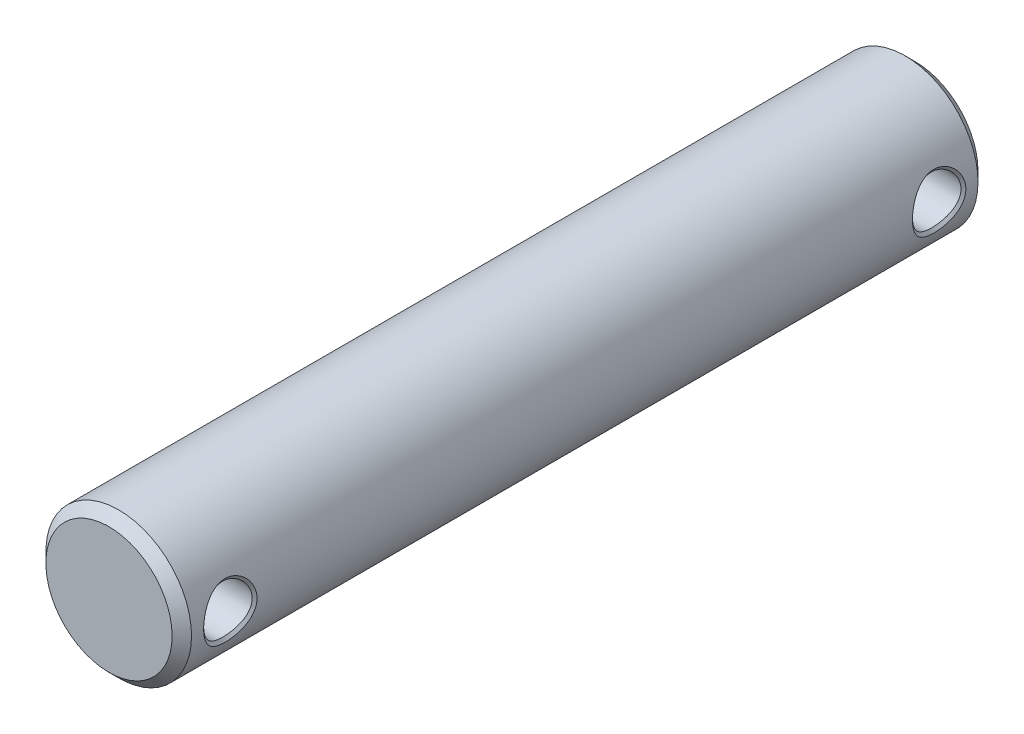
ISO-10303-21;
HEADER;
FILE_DESCRIPTION(('STEP AP214'),'2;1');
FILE_NAME('part.step','',(''),(''),'','','');
FILE_SCHEMA(('AUTOMOTIVE_DESIGN { 1 0 10303 214 1 1 1 1 }'));
ENDSEC;
DATA;
#1=APPLICATION_CONTEXT('core data for automotive mechanical design processes');
#2=APPLICATION_PROTOCOL_DEFINITION('international standard','automotive_design',2000,#1);
#3=PRODUCT_CONTEXT('',#1,'mechanical');
#4=PRODUCT('Part','Part','',(#3));
#5=PRODUCT_RELATED_PRODUCT_CATEGORY('part','',(#4));
#6=PRODUCT_DEFINITION_FORMATION('','',#4);
#7=PRODUCT_DEFINITION_CONTEXT('part definition',#1,'design');
#8=PRODUCT_DEFINITION('design','',#6,#7);
#9=PRODUCT_DEFINITION_SHAPE('','',#8);
#10=(LENGTH_UNIT() NAMED_UNIT(*) SI_UNIT(.MILLI.,.METRE.));
#11=(NAMED_UNIT(*) PLANE_ANGLE_UNIT() SI_UNIT($,.RADIAN.));
#12=(NAMED_UNIT(*) SI_UNIT($,.STERADIAN.) SOLID_ANGLE_UNIT());
#13=UNCERTAINTY_MEASURE_WITH_UNIT(LENGTH_MEASURE(1.E-05),#10,'distance_accuracy_value','');
#14=(GEOMETRIC_REPRESENTATION_CONTEXT(3) GLOBAL_UNCERTAINTY_ASSIGNED_CONTEXT((#13)) GLOBAL_UNIT_ASSIGNED_CONTEXT((#10,
#11,#12)) REPRESENTATION_CONTEXT('',''));
#15=CARTESIAN_POINT('',(0.,0.,0.));
#16=DIRECTION('',(0.,0.,1.));
#17=DIRECTION('',(1.,0.,0.));
#18=AXIS2_PLACEMENT_3D('',#15,#16,#17);
#19=CARTESIAN_POINT('',(0.,0.,166.));
#20=DIRECTION('',(0.,0.,-1.));
#21=DIRECTION('',(-1.,0.,0.));
#22=AXIS2_PLACEMENT_3D('',#19,#20,#21);
#23=CYLINDRICAL_SURFACE('',#22,15.);
#24=CARTESIAN_POINT('',(-15.,0.,161.499999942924));
#25=CARTESIAN_POINT('',(-14.9999813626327,0.0942102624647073,161.499940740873));
#26=CARTESIAN_POINT('',(-14.9989718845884,0.188413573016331,161.497529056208));
#27=CARTESIAN_POINT('',(-14.9950698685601,0.376327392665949,161.48808421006));
#28=CARTESIAN_POINT('',(-14.9921817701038,0.470038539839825,161.48106194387));
#29=CARTESIAN_POINT('',(-14.9846266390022,0.656774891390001,161.462494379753));
#30=CARTESIAN_POINT('',(-14.9799626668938,0.749800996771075,161.450956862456));
#31=CARTESIAN_POINT('',(-14.9689611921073,0.934978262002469,161.423459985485));
#32=CARTESIAN_POINT('',(-14.96262576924,1.02713036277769,161.407506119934));
#33=CARTESIAN_POINT('',(-14.9483859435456,1.21036976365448,161.37127592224));
#34=CARTESIAN_POINT('',(-14.9404829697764,1.30145795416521,161.351003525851));
#35=CARTESIAN_POINT('',(-14.9232124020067,1.48238000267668,161.306235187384));
#36=CARTESIAN_POINT('',(-14.9138458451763,1.57221470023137,161.281742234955));
#37=CARTESIAN_POINT('',(-14.8937521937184,1.75044012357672,161.228631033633));
#38=CARTESIAN_POINT('',(-14.8830259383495,1.83883170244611,161.200015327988));
#39=CARTESIAN_POINT('',(-14.8603167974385,2.0139811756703,161.138756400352));
#40=CARTESIAN_POINT('',(-14.8483346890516,2.10074004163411,161.106115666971));
#41=CARTESIAN_POINT('',(-14.82321763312,2.27243424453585,161.036904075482));
#42=CARTESIAN_POINT('',(-14.8100834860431,2.35737079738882,161.000335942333));
#43=CARTESIAN_POINT('',(-14.7827660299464,2.52523038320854,160.923366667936));
#44=CARTESIAN_POINT('',(-14.7685835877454,2.60815500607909,160.882968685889));
#45=CARTESIAN_POINT('',(-14.7392733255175,2.77180061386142,160.798436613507));
#46=CARTESIAN_POINT('',(-14.7241464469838,2.8525236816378,160.754306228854));
#47=CARTESIAN_POINT('',(-14.6930505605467,3.01157587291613,160.662406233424));
#48=CARTESIAN_POINT('',(-14.6770825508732,3.08990766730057,160.614640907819));
#49=CARTESIAN_POINT('',(-14.6444096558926,3.24398712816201,160.51556754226));
#50=CARTESIAN_POINT('',(-14.627705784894,3.31973811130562,160.464264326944));
#51=CARTESIAN_POINT('',(-14.5936590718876,3.46846487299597,160.358212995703));
#52=CARTESIAN_POINT('',(-14.5763172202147,3.54144462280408,160.303470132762));
#53=CARTESIAN_POINT('',(-14.5411200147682,3.68444093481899,160.190632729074));
#54=CARTESIAN_POINT('',(-14.5232655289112,3.75446206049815,160.132543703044));
#55=CARTESIAN_POINT('',(-14.4870661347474,3.89134165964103,160.01312486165));
#56=CARTESIAN_POINT('',(-14.468722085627,3.95820516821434,159.951800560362));
#57=CARTESIAN_POINT('',(-14.4319459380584,4.08862078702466,159.825949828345));
#58=CARTESIAN_POINT('',(-14.4135140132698,4.15217772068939,159.761428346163));
#59=CARTESIAN_POINT('',(-14.3769871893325,4.27592160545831,159.629310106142));
#60=CARTESIAN_POINT('',(-14.3588918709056,4.3361129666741,159.561717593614));
#61=CARTESIAN_POINT('',(-14.323083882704,4.45301567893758,159.423655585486));
#62=CARTESIAN_POINT('',(-14.3053707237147,4.50973167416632,159.353190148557));
#63=CARTESIAN_POINT('',(-14.270474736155,4.61958483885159,159.209562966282));
#64=CARTESIAN_POINT('',(-14.2532911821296,4.67272703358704,159.13640524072));
#65=CARTESIAN_POINT('',(-14.2195748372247,4.7753305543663,158.987578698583));
#66=CARTESIAN_POINT('',(-14.2030410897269,4.82479739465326,158.911913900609));
#67=CARTESIAN_POINT('',(-14.1707521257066,4.91994887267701,158.758257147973));
#68=CARTESIAN_POINT('',(-14.1549956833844,4.96563954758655,158.680269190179));
#69=CARTESIAN_POINT('',(-14.1243871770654,5.05313710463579,158.522150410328));
#70=CARTESIAN_POINT('',(-14.1095336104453,5.09495050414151,158.442023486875));
#71=CARTESIAN_POINT('',(-14.0808572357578,5.17459202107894,158.279811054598));
#72=CARTESIAN_POINT('',(-14.0670326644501,5.21242700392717,158.197729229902));
#73=CARTESIAN_POINT('',(-14.0405405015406,5.28401031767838,158.031791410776));
#74=CARTESIAN_POINT('',(-14.0278709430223,5.31776562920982,157.947938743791));
#75=CARTESIAN_POINT('',(-14.003815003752,5.38108846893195,157.778643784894));
#76=CARTESIAN_POINT('',(-13.9924265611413,5.41066274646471,157.693204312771));
#77=CARTESIAN_POINT('',(-13.971058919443,5.46552275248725,157.52092043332));
#78=CARTESIAN_POINT('',(-13.9610777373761,5.49081452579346,157.434078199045));
#79=CARTESIAN_POINT('',(-13.94265052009,5.53700919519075,157.259173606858));
#80=CARTESIAN_POINT('',(-13.9342028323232,5.55791681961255,157.17111267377));
#81=CARTESIAN_POINT('',(-13.9189681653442,5.59524366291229,156.993955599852));
#82=CARTESIAN_POINT('',(-13.9121802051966,5.61166553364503,156.904860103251));
#83=CARTESIAN_POINT('',(-13.900390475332,5.63992146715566,156.725818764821));
#84=CARTESIAN_POINT('',(-13.895388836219,5.65175519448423,156.635872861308));
#85=CARTESIAN_POINT('',(-13.8872957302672,5.67073879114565,156.455315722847));
#86=CARTESIAN_POINT('',(-13.8842060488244,5.6778842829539,156.364703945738));
#87=CARTESIAN_POINT('',(-13.8800641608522,5.68738736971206,156.182998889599));
#88=CARTESIAN_POINT('',(-13.8790160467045,5.68973534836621,156.091905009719));
#89=CARTESIAN_POINT('',(-13.879069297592,5.68957473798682,155.909728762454));
#90=CARTESIAN_POINT('',(-13.8801705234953,5.68706646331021,155.818646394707));
#91=CARTESIAN_POINT('',(-13.8843977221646,5.677292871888,155.636982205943));
#92=CARTESIAN_POINT('',(-13.8875193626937,5.67003773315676,155.546399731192));
#93=CARTESIAN_POINT('',(-13.8956634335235,5.65086737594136,155.36591503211));
#94=CARTESIAN_POINT('',(-13.9006838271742,5.63895715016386,155.276012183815));
#95=CARTESIAN_POINT('',(-13.9124983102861,5.61058134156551,155.097066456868));
#96=CARTESIAN_POINT('',(-13.9192920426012,5.59411667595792,155.008023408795));
#97=CARTESIAN_POINT('',(-13.9345277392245,5.55673318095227,154.830976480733));
#98=CARTESIAN_POINT('',(-13.9429704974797,5.53581220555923,154.742973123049));
#99=CARTESIAN_POINT('',(-13.9613790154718,5.48961692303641,154.568184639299));
#100=CARTESIAN_POINT('',(-13.9713462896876,5.46433828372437,154.481400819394));
#101=CARTESIAN_POINT('',(-13.9926790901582,5.40952747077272,154.309230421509));
#102=CARTESIAN_POINT('',(-14.0040465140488,5.37998951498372,154.223845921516));
#103=CARTESIAN_POINT('',(-14.0280551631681,5.3167591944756,154.054653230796));
#104=CARTESIAN_POINT('',(-14.0406984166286,5.28306019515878,153.970847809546));
#105=CARTESIAN_POINT('',(-14.0671345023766,5.21160631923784,153.80499245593));
#106=CARTESIAN_POINT('',(-14.0809293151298,5.17384442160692,153.722945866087));
#107=CARTESIAN_POINT('',(-14.1095444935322,5.09436284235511,153.560787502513));
#108=CARTESIAN_POINT('',(-14.1243666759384,5.05263609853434,153.480679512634));
#109=CARTESIAN_POINT('',(-14.1549125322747,4.96532255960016,153.322577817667));
#110=CARTESIAN_POINT('',(-14.1706377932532,4.91972889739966,153.244588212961));
#111=CARTESIAN_POINT('',(-14.2028663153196,4.82477913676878,153.090902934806));
#112=CARTESIAN_POINT('',(-14.2193709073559,4.77541650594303,153.015211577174));
#113=CARTESIAN_POINT('',(-14.2530326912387,4.67302589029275,152.866302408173));
#114=CARTESIAN_POINT('',(-14.2701909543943,4.61999176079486,152.793089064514));
#115=CARTESIAN_POINT('',(-14.3050418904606,4.5103566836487,152.649316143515));
#116=CARTESIAN_POINT('',(-14.3227354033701,4.45374996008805,152.578761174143));
#117=CARTESIAN_POINT('',(-14.3585116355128,4.33706263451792,152.440483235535));
#118=CARTESIAN_POINT('',(-14.3765949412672,4.27697652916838,152.372765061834));
#119=CARTESIAN_POINT('',(-14.4131065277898,4.15344449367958,152.240346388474));
#120=CARTESIAN_POINT('',(-14.4315353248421,4.08999322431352,152.175651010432));
#121=CARTESIAN_POINT('',(-14.4683140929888,3.95977244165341,152.049441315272));
#122=CARTESIAN_POINT('',(-14.4866638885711,3.89299773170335,151.987932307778));
#123=CARTESIAN_POINT('',(-14.5228805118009,3.75626543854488,151.86817588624));
#124=CARTESIAN_POINT('',(-14.540746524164,3.68630295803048,151.809933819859));
#125=CARTESIAN_POINT('',(-14.5759709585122,3.54340265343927,151.696812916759));
#126=CARTESIAN_POINT('',(-14.593328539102,3.4704603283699,151.641939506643));
#127=CARTESIAN_POINT('',(-14.6274099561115,3.32178672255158,151.535650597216));
#128=CARTESIAN_POINT('',(-14.644132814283,3.24605146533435,151.484240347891));
#129=CARTESIAN_POINT('',(-14.6768458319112,3.09198385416,151.384974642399));
#130=CARTESIAN_POINT('',(-14.6928349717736,3.01364813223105,151.337124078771));
#131=CARTESIAN_POINT('',(-14.7239742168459,2.85456988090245,151.245074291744));
#132=CARTESIAN_POINT('',(-14.7391233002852,2.77382459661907,151.200879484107));
#133=CARTESIAN_POINT('',(-14.7684780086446,2.61011791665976,151.116238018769));
#134=CARTESIAN_POINT('',(-14.7826826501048,2.52715433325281,151.07579525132));
#135=CARTESIAN_POINT('',(-14.8100434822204,2.35920169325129,150.998754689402));
#136=CARTESIAN_POINT('',(-14.823198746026,2.27421093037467,150.962160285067));
#137=CARTESIAN_POINT('',(-14.8483559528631,2.10239468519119,150.892913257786));
#138=CARTESIAN_POINT('',(-14.8603570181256,2.01556786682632,150.860263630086));
#139=CARTESIAN_POINT('',(-14.8831009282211,1.84027036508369,150.799002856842));
#140=CARTESIAN_POINT('',(-14.8938429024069,1.75179859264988,150.770394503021));
#141=CARTESIAN_POINT('',(-14.9139637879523,1.57340215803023,150.717312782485));
#142=CARTESIAN_POINT('',(-14.9233417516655,1.48347653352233,150.692842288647));
#143=CARTESIAN_POINT('',(-14.9406298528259,1.30236347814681,150.648132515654));
#144=CARTESIAN_POINT('',(-14.9485388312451,1.2111751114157,150.627896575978));
#145=CARTESIAN_POINT('',(-14.962784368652,1.02772775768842,150.59175170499));
#146=CARTESIAN_POINT('',(-14.9691193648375,0.935467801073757,150.575847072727));
#147=CARTESIAN_POINT('',(-14.9801124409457,0.750068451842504,150.548460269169));
#148=CARTESIAN_POINT('',(-14.9847682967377,0.656928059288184,150.536983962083));
#149=CARTESIAN_POINT('',(-14.9922992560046,0.469959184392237,150.518548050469));
#150=CARTESIAN_POINT('',(-14.9951711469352,0.37612976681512,150.51159659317));
#151=CARTESIAN_POINT('',(-14.9990292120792,0.187973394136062,150.50230612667));
#152=CARTESIAN_POINT('',(-15.0000107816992,0.0936457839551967,150.499978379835));
#153=CARTESIAN_POINT('',(-14.9999891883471,-0.0949994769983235,150.500021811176));
#154=CARTESIAN_POINT('',(-14.998986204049,-0.189317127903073,150.502392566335));
#155=CARTESIAN_POINT('',(-14.9950930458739,-0.377435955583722,150.511757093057));
#156=CARTESIAN_POINT('',(-14.9922077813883,-0.471237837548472,150.51873883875));
#157=CARTESIAN_POINT('',(-14.9846549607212,-0.658136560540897,150.537227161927));
#158=CARTESIAN_POINT('',(-14.9799908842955,-0.751234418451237,150.548724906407));
#159=CARTESIAN_POINT('',(-14.9689863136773,-0.936536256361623,150.576145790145));
#160=CARTESIAN_POINT('',(-14.962648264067,-1.02874133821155,150.592062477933));
#161=CARTESIAN_POINT('',(-14.9484008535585,-1.2120691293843,150.628223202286));
#162=CARTESIAN_POINT('',(-14.9404932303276,-1.30319291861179,150.648462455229));
#163=CARTESIAN_POINT('',(-14.9232115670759,-1.48416965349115,150.693170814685));
#164=CARTESIAN_POINT('',(-14.9138388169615,-1.57402364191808,150.717636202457));
#165=CARTESIAN_POINT('',(-14.8937315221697,-1.75227229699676,150.770699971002));
#166=CARTESIAN_POINT('',(-14.8829980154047,-1.84066801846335,150.79929520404));
#167=CARTESIAN_POINT('',(-14.86027365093,-2.01581158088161,150.860522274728));
#168=CARTESIAN_POINT('',(-14.8482837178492,-2.10256057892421,150.893151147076));
#169=CARTESIAN_POINT('',(-14.8231508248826,-2.27422202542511,150.962349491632));
#170=CARTESIAN_POINT('',(-14.8100087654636,-2.35913584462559,150.998915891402));
#171=CARTESIAN_POINT('',(-14.7826758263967,-2.52693812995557,151.075893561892));
#172=CARTESIAN_POINT('',(-14.7684858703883,-2.60982829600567,151.116301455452));
#173=CARTESIAN_POINT('',(-14.7391614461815,-2.77339436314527,151.200866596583));
#174=CARTESIAN_POINT('',(-14.7240279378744,-2.85407239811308,151.24502004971));
#175=CARTESIAN_POINT('',(-14.6929201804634,-3.01302510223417,151.336980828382));
#176=CARTESIAN_POINT('',(-14.6769469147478,-3.09130241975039,151.384783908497));
#177=CARTESIAN_POINT('',(-14.6442653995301,-3.2452647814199,151.48394876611));
#178=CARTESIAN_POINT('',(-14.6275581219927,-3.3209530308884,151.535305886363));
#179=CARTESIAN_POINT('',(-14.59350703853,-3.46954726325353,151.641482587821));
#180=CARTESIAN_POINT('',(-14.576164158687,-3.54245700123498,151.69629720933));
#181=CARTESIAN_POINT('',(-14.5409676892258,-3.68530810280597,151.809296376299));
#182=CARTESIAN_POINT('',(-14.5231148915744,-3.75525369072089,151.867475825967));
#183=CARTESIAN_POINT('',(-14.4869227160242,-3.89197603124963,151.987097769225));
#184=CARTESIAN_POINT('',(-14.4685841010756,-3.95875734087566,152.04853528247));
#185=CARTESIAN_POINT('',(-14.4318209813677,-4.08901280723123,152.174626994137));
#186=CARTESIAN_POINT('',(-14.4133966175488,-4.15249111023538,152.239276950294));
#187=CARTESIAN_POINT('',(-14.3768842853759,-4.276092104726,152.371656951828));
#188=CARTESIAN_POINT('',(-14.3587959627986,-4.33621848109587,152.439383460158));
#189=CARTESIAN_POINT('',(-14.3230017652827,-4.45300259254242,152.57771896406));
#190=CARTESIAN_POINT('',(-14.3052954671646,-4.50966430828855,152.648324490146));
#191=CARTESIAN_POINT('',(-14.2704127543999,-4.61942023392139,152.792234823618));
#192=CARTESIAN_POINT('',(-14.2532356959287,-4.67251887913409,152.865536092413));
#193=CARTESIAN_POINT('',(-14.2195318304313,-4.7750457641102,153.014651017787));
#194=CARTESIAN_POINT('',(-14.2030041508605,-4.82447901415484,153.09046103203));
#195=CARTESIAN_POINT('',(-14.1707267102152,-4.91957311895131,153.244407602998));
#196=CARTESIAN_POINT('',(-14.1549758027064,-4.96523960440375,153.322540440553));
#197=CARTESIAN_POINT('',(-14.1243776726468,-5.0526978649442,153.480946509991));
#198=CARTESIAN_POINT('',(-14.1095290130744,-5.09449586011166,153.561216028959));
#199=CARTESIAN_POINT('',(-14.0808616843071,-5.17411492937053,153.723709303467));
#200=CARTESIAN_POINT('',(-14.0670412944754,-5.2119426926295,153.805929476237));
#201=CARTESIAN_POINT('',(-14.040556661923,-5.28351919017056,153.972137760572));
#202=CARTESIAN_POINT('',(-14.0278904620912,-5.31727486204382,154.056122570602));
#203=CARTESIAN_POINT('',(-14.0038403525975,-5.38060529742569,154.225673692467));
#204=CARTESIAN_POINT('',(-13.9924543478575,-5.41018691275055,154.311237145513));
#205=CARTESIAN_POINT('',(-13.9710906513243,-5.46506770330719,154.483758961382));
#206=CARTESIAN_POINT('',(-13.9611108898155,-5.49037318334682,154.570715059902));
#207=CARTESIAN_POINT('',(-13.9426855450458,-5.53660061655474,154.745835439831));
#208=CARTESIAN_POINT('',(-13.9342381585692,-5.55752772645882,154.83399816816));
#209=CARTESIAN_POINT('',(-13.9190031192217,-5.59489804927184,155.01134496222));
#210=CARTESIAN_POINT('',(-13.912214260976,-5.6113445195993,155.1005282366));
#211=CARTESIAN_POINT('',(-13.9004216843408,-5.63965358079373,155.279729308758));
#212=CARTESIAN_POINT('',(-13.8954177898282,-5.65151662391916,155.369747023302));
#213=CARTESIAN_POINT('',(-13.8873193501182,-5.67056118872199,155.550430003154));
#214=CARTESIAN_POINT('',(-13.8842261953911,-5.67773930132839,155.641095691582));
#215=CARTESIAN_POINT('',(-13.8800756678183,-5.68731214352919,155.822888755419));
#216=CARTESIAN_POINT('',(-13.8790218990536,-5.68969840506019,155.914016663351));
#217=CARTESIAN_POINT('',(-13.8790654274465,-5.68960684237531,156.096236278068));
#218=CARTESIAN_POINT('',(-13.880161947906,-5.68713077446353,156.187327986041));
#219=CARTESIAN_POINT('',(-13.8843842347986,-5.67740422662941,156.368983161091));
#220=CARTESIAN_POINT('',(-13.887505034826,-5.67016543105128,156.4595473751));
#221=CARTESIAN_POINT('',(-13.8956504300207,-5.65101540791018,156.639970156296));
#222=CARTESIAN_POINT('',(-13.9006724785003,-5.63911042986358,156.72982950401));
#223=CARTESIAN_POINT('',(-13.9124929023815,-5.61073398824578,156.908665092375));
#224=CARTESIAN_POINT('',(-13.9192905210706,-5.59426446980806,156.997641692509));
#225=CARTESIAN_POINT('',(-13.9345359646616,-5.55686235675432,157.174534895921));
#226=CARTESIAN_POINT('',(-13.9429842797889,-5.53592843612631,157.262451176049));
#227=CARTESIAN_POINT('',(-13.9614053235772,-5.48970027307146,157.437047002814));
#228=CARTESIAN_POINT('',(-13.9713793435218,-5.46440233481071,157.523725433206));
#229=CARTESIAN_POINT('',(-13.9927264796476,-5.40954790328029,157.69566889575));
#230=CARTESIAN_POINT('',(-14.0041013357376,-5.37998610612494,157.780932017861));
#231=CARTESIAN_POINT('',(-14.0281251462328,-5.31670500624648,157.949868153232));
#232=CARTESIAN_POINT('',(-14.0407760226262,-5.282979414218,158.033538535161));
#233=CARTESIAN_POINT('',(-14.0672271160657,-5.21147116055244,158.199112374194));
#234=CARTESIAN_POINT('',(-14.0810292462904,-5.17368171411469,158.281012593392));
#235=CARTESIAN_POINT('',(-14.1096582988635,-5.09414572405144,158.442869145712));
#236=CARTESIAN_POINT('',(-14.1244869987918,-5.0523922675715,158.522821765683));
#237=CARTESIAN_POINT('',(-14.1550446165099,-4.96502784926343,158.680606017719));
#238=CARTESIAN_POINT('',(-14.1707751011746,-4.91941010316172,158.75843358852));
#239=CARTESIAN_POINT('',(-14.2030122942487,-4.82441655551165,158.911790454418));
#240=CARTESIAN_POINT('',(-14.2195203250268,-4.77503425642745,158.987315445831));
#241=CARTESIAN_POINT('',(-14.2531867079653,-4.67261051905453,159.135889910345));
#242=CARTESIAN_POINT('',(-14.2703461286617,-4.61956294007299,159.208934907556));
#243=CARTESIAN_POINT('',(-14.3051966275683,-4.50990893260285,159.352371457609));
#244=CARTESIAN_POINT('',(-14.3228885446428,-4.45329671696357,159.422758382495));
#245=CARTESIAN_POINT('',(-14.3586582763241,-4.3366083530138,159.560703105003));
#246=CARTESIAN_POINT('',(-14.3767366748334,-4.27652668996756,159.62825608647));
#247=CARTESIAN_POINT('',(-14.4132349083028,-4.15301455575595,159.760348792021));
#248=CARTESIAN_POINT('',(-14.4316552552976,-4.08957874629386,159.824883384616));
#249=CARTESIAN_POINT('',(-14.468416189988,-3.95938994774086,159.950795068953));
#250=CARTESIAN_POINT('',(-14.4867565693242,-3.89263108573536,160.012166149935));
#251=CARTESIAN_POINT('',(-14.5229568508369,-3.75592210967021,160.131685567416));
#252=CARTESIAN_POINT('',(-14.540815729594,-3.68596593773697,160.189827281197));
#253=CARTESIAN_POINT('',(-14.5760283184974,-3.54307124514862,160.302781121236));
#254=CARTESIAN_POINT('',(-14.5933810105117,-3.47012733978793,160.357586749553));
#255=CARTESIAN_POINT('',(-14.6274546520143,-3.321445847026,160.463769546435));
#256=CARTESIAN_POINT('',(-14.6441744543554,-3.24570363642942,160.515140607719));
#257=CARTESIAN_POINT('',(-14.6768830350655,-3.0916194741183,160.614352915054));
#258=CARTESIAN_POINT('',(-14.6928706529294,-3.01327371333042,160.662188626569));
#259=CARTESIAN_POINT('',(-14.7240081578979,-2.8541749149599,160.754229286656));
#260=CARTESIAN_POINT('',(-14.7391569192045,-2.77341885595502,160.798429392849));
#261=CARTESIAN_POINT('',(-14.7685119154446,-2.60969234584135,160.883097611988));
#262=CARTESIAN_POINT('',(-14.7827171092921,-2.52671958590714,160.923561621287));
#263=CARTESIAN_POINT('',(-14.8100795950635,-2.35875253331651,161.000656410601));
#264=CARTESIAN_POINT('',(-14.8232359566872,-2.27375653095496,161.037283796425));
#265=CARTESIAN_POINT('',(-14.8483955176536,-2.10193599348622,161.106604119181));
#266=CARTESIAN_POINT('',(-14.8603978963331,-2.01511020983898,161.139294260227));
#267=CARTESIAN_POINT('',(-14.883144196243,-1.83982323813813,161.200638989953));
#268=CARTESIAN_POINT('',(-14.8938873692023,-1.75136111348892,161.229291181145));
#269=CARTESIAN_POINT('',(-14.9140100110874,-1.57299472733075,161.282459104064));
#270=CARTESIAN_POINT('',(-14.9233887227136,-1.48308969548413,161.306972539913));
#271=CARTESIAN_POINT('',(-14.9406772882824,-1.30203091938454,161.351762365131));
#272=CARTESIAN_POINT('',(-14.9485862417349,-1.21087644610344,161.372036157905));
#273=CARTESIAN_POINT('',(-14.9628302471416,-1.02751224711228,161.408246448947));
#274=CARTESIAN_POINT('',(-14.969164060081,-0.935301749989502,161.424179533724));
#275=CARTESIAN_POINT('',(-14.9801530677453,-0.750019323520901,161.45160894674));
#276=CARTESIAN_POINT('',(-14.9848064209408,-0.656946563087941,161.463100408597));
#277=CARTESIAN_POINT('',(-14.9923296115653,-0.47013234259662,161.481546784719));
#278=CARTESIAN_POINT('',(-14.9951966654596,-0.376390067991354,161.488494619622));
#279=CARTESIAN_POINT('',(-14.9990444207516,-0.18843352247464,161.497758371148));
#280=CARTESIAN_POINT('',(-15.0000209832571,-0.0942186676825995,161.500064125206));
#281=CARTESIAN_POINT('',(-15.,0.,161.499999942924));
#282=B_SPLINE_CURVE_WITH_KNOTS('',3,(#24,#25,#26,#27,#28,#29,#30,#31,#32,#33,#34,#35,#36,#37,
#38,#39,#40,#41,#42,#43,#44,#45,#46,#47,#48,#49,#50,#51,#52,#53,#54,#55,#56,#57,#58,#59,#60,#61,
#62,#63,#64,#65,#66,#67,#68,#69,#70,#71,#72,#73,#74,#75,#76,#77,#78,#79,#80,#81,#82,#83,#84,#85,
#86,#87,#88,#89,#90,#91,#92,#93,#94,#95,#96,#97,#98,#99,#100,#101,#102,#103,#104,#105,#106,#107,
#108,#109,#110,#111,#112,#113,#114,#115,#116,#117,#118,#119,#120,#121,#122,#123,#124,#125,#126,
#127,#128,#129,#130,#131,#132,#133,#134,#135,#136,#137,#138,#139,#140,#141,#142,#143,#144,#145,
#146,#147,#148,#149,#150,#151,#152,#153,#154,#155,#156,#157,#158,#159,#160,#161,#162,#163,#164,
#165,#166,#167,#168,#169,#170,#171,#172,#173,#174,#175,#176,#177,#178,#179,#180,#181,#182,#183,
#184,#185,#186,#187,#188,#189,#190,#191,#192,#193,#194,#195,#196,#197,#198,#199,#200,#201,#202,
#203,#204,#205,#206,#207,#208,#209,#210,#211,#212,#213,#214,#215,#216,#217,#218,#219,#220,#221,
#222,#223,#224,#225,#226,#227,#228,#229,#230,#231,#232,#233,#234,#235,#236,#237,#238,#239,#240,
#241,#242,#243,#244,#245,#246,#247,#248,#249,#250,#251,#252,#253,#254,#255,#256,#257,#258,#259,
#260,#261,#262,#263,#264,#265,#266,#267,#268,#269,#270,#271,#272,#273,#274,#275,#276,#277,#278,
#279,#280,#281),.UNSPECIFIED.,.F.,.F.,(4,2,2,2,2,2,2,2,2,2,2,2,2,2,2,2,2,2,2,2,2,2,2,2,2,2,2,2,
2,2,2,2,2,2,2,2,2,2,2,2,2,2,2,2,2,2,2,2,2,2,2,2,2,2,2,2,2,2,2,2,2,2,2,2,2,2,2,2,2,2,2,2,2,2,2,2,
2,2,2,2,2,2,2,2,2,2,2,2,2,2,2,2,2,2,2,2,2,2,2,2,2,2,2,2,2,2,2,2,2,2,2,2,2,2,2,2,2,2,2,2,2,2,2,2,
2,2,2,2,4),(0.,0.282588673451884,0.564511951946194,0.845951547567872,1.12704258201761,
1.40787852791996,1.68851635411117,1.96898179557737,2.24927469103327,2.52937435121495,
2.80924493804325,3.08884084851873,3.36811210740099,3.64700977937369,3.92549141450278,
4.20352654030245,4.48110220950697,4.7582609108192,5.03504748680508,5.31145573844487,
5.58746682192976,5.86305506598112,6.13819382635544,6.41286138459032,6.68704689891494,
6.96075641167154,7.23401890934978,7.50689241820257,7.77947010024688,8.05188629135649,
8.32432239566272,8.597012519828,8.87024869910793,9.14346719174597,9.41610177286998,
9.68844474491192,9.96073291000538,10.2331524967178,10.5058444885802,10.778910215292,
11.0524170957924,11.326404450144,11.6008893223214,11.8758722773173,12.1513431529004,
12.4272867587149,12.7036885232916,12.9805400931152,13.2578448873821,13.5355978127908,
13.8137928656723,14.0924249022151,14.371470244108,14.6508922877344,14.9306470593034,
15.2106887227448,15.4909750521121,15.771472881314,16.0521635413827,16.3330482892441,
16.6141537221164,16.8955371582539,17.1772919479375,17.4595526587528,17.7425000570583,
18.0254219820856,18.3076089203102,18.5892466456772,18.8704753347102,19.1513943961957,
19.4320675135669,19.7125278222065,19.9927831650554,20.2728213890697,20.5526156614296,
20.8321297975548,21.111323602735,21.3901582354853,21.6686016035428,21.9466338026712,
22.2242526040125,22.5015140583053,22.7784644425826,23.0550904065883,23.3313653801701,
23.6072554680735,23.8827253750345,24.1577443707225,24.4322923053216,24.7063656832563,
24.9799837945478,25.2531948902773,25.5260823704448,25.7987709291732,26.0714325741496,
26.3442924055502,26.6176340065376,26.8908768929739,27.1634519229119,27.4356631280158,
27.7077585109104,27.9799348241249,28.2523427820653,28.5250925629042,28.7982594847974,
29.0718897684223,29.3460063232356,29.6206145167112,29.8957079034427,30.1712739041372,
30.4472994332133,30.723776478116,31.0007076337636,31.2781469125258,31.5561356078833,
31.8346494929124,32.1136461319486,32.3930706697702,32.6728615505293,32.9529561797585,
33.2332965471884,33.5138348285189,33.7945389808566,34.0753983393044,34.3564292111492,
34.6376804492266,34.9192389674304,35.2012351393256,35.4838479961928),.UNSPECIFIED.);
#283=CARTESIAN_POINT('',(-15.,0.,161.499999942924));
#284=VERTEX_POINT('',#283);
#285=EDGE_CURVE('E56',#284,#284,#282,.F.);
#286=ORIENTED_EDGE('',*,*,#285,.T.);
#287=EDGE_LOOP('',(#286));
#288=FACE_BOUND('',#287,.T.);
#289=CARTESIAN_POINT('',(15.,0.,150.500000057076));
#290=CARTESIAN_POINT('',(14.9999813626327,0.0942102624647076,150.500059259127));
#291=CARTESIAN_POINT('',(14.9989718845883,0.188413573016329,150.502470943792));
#292=CARTESIAN_POINT('',(14.9950698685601,0.376327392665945,150.51191578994));
#293=CARTESIAN_POINT('',(14.9921817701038,0.470038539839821,150.51893805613));
#294=CARTESIAN_POINT('',(14.9846266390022,0.656774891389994,150.537505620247));
#295=CARTESIAN_POINT('',(14.9799626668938,0.749800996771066,150.549043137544));
#296=CARTESIAN_POINT('',(14.9689611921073,0.934978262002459,150.576540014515));
#297=CARTESIAN_POINT('',(14.96262576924,1.02713036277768,150.592493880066));
#298=CARTESIAN_POINT('',(14.9483859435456,1.21036976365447,150.62872407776));
#299=CARTESIAN_POINT('',(14.9404829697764,1.3014579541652,150.648996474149));
#300=CARTESIAN_POINT('',(14.9232124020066,1.48238000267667,150.693764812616));
#301=CARTESIAN_POINT('',(14.9138458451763,1.57221470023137,150.718257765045));
#302=CARTESIAN_POINT('',(14.8937521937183,1.75044012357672,150.771368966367));
#303=CARTESIAN_POINT('',(14.8830259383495,1.83883170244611,150.799984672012));
#304=CARTESIAN_POINT('',(14.8603167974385,2.0139811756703,150.861243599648));
#305=CARTESIAN_POINT('',(14.8483346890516,2.10074004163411,150.893884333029));
#306=CARTESIAN_POINT('',(14.82321763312,2.27243424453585,150.963095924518));
#307=CARTESIAN_POINT('',(14.8100834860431,2.35737079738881,150.999664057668));
#308=CARTESIAN_POINT('',(14.7827660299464,2.52523038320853,151.076633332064));
#309=CARTESIAN_POINT('',(14.7685835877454,2.60815500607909,151.117031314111));
#310=CARTESIAN_POINT('',(14.7392733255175,2.77180061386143,151.201563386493));
#311=CARTESIAN_POINT('',(14.7241464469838,2.85252368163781,151.245693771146));
#312=CARTESIAN_POINT('',(14.6930505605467,3.01157587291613,151.337593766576));
#313=CARTESIAN_POINT('',(14.6770825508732,3.08990766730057,151.385359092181));
#314=CARTESIAN_POINT('',(14.6444096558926,3.24398712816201,151.48443245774));
#315=CARTESIAN_POINT('',(14.6277057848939,3.31973811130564,151.535735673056));
#316=CARTESIAN_POINT('',(14.5936590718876,3.46846487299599,151.641787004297));
#317=CARTESIAN_POINT('',(14.5763172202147,3.54144462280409,151.696529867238));
#318=CARTESIAN_POINT('',(14.5411200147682,3.68444093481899,151.809367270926));
#319=CARTESIAN_POINT('',(14.5232655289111,3.75446206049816,151.867456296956));
#320=CARTESIAN_POINT('',(14.4870661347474,3.89134165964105,151.98687513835));
#321=CARTESIAN_POINT('',(14.468722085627,3.95820516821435,152.048199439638));
#322=CARTESIAN_POINT('',(14.4319459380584,4.08862078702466,152.174050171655));
#323=CARTESIAN_POINT('',(14.4135140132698,4.15217772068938,152.238571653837));
#324=CARTESIAN_POINT('',(14.3769871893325,4.27592160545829,152.370689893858));
#325=CARTESIAN_POINT('',(14.3588918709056,4.3361129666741,152.438282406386));
#326=CARTESIAN_POINT('',(14.3230838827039,4.45301567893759,152.576344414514));
#327=CARTESIAN_POINT('',(14.3053707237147,4.50973167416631,152.646809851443));
#328=CARTESIAN_POINT('',(14.2704747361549,4.61958483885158,152.790437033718));
#329=CARTESIAN_POINT('',(14.2532911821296,4.67272703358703,152.86359475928));
#330=CARTESIAN_POINT('',(14.2195748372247,4.77533055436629,153.012421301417));
#331=CARTESIAN_POINT('',(14.2030410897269,4.82479739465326,153.088086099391));
#332=CARTESIAN_POINT('',(14.1707521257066,4.919948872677,153.241742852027));
#333=CARTESIAN_POINT('',(14.1549956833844,4.96563954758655,153.319730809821));
#334=CARTESIAN_POINT('',(14.1243871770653,5.05313710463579,153.477849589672));
#335=CARTESIAN_POINT('',(14.1095336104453,5.09495050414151,153.557976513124));
#336=CARTESIAN_POINT('',(14.0808572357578,5.17459202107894,153.720188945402));
#337=CARTESIAN_POINT('',(14.0670326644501,5.21242700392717,153.802270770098));
#338=CARTESIAN_POINT('',(14.0405405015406,5.28401031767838,153.968208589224));
#339=CARTESIAN_POINT('',(14.0278709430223,5.31776562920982,154.052061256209));
#340=CARTESIAN_POINT('',(14.003815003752,5.38108846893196,154.221356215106));
#341=CARTESIAN_POINT('',(13.9924265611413,5.41066274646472,154.306795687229));
#342=CARTESIAN_POINT('',(13.971058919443,5.46552275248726,154.47907956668));
#343=CARTESIAN_POINT('',(13.961077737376,5.49081452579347,154.565921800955));
#344=CARTESIAN_POINT('',(13.94265052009,5.53700919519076,154.740826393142));
#345=CARTESIAN_POINT('',(13.9342028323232,5.55791681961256,154.82888732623));
#346=CARTESIAN_POINT('',(13.9189681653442,5.59524366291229,155.006044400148));
#347=CARTESIAN_POINT('',(13.9121802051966,5.61166553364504,155.095139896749));
#348=CARTESIAN_POINT('',(13.900390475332,5.63992146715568,155.274181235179));
#349=CARTESIAN_POINT('',(13.895388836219,5.65175519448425,155.364127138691));
#350=CARTESIAN_POINT('',(13.8872957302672,5.67073879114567,155.544684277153));
#351=CARTESIAN_POINT('',(13.8842060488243,5.67788428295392,155.635296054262));
#352=CARTESIAN_POINT('',(13.8800641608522,5.68738736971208,155.817001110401));
#353=CARTESIAN_POINT('',(13.8790160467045,5.68973534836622,155.908094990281));
#354=CARTESIAN_POINT('',(13.879069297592,5.68957473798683,156.090271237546));
#355=CARTESIAN_POINT('',(13.8801705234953,5.68706646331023,156.181353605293));
#356=CARTESIAN_POINT('',(13.8843977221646,5.67729287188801,156.363017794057));
#357=CARTESIAN_POINT('',(13.8875193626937,5.67003773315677,156.453600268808));
#358=CARTESIAN_POINT('',(13.8956634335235,5.65086737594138,156.63408496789));
#359=CARTESIAN_POINT('',(13.9006838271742,5.63895715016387,156.723987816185));
#360=CARTESIAN_POINT('',(13.9124983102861,5.61058134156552,156.902933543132));
#361=CARTESIAN_POINT('',(13.9192920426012,5.59411667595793,156.991976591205));
#362=CARTESIAN_POINT('',(13.9345277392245,5.55673318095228,157.169023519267));
#363=CARTESIAN_POINT('',(13.9429704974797,5.53581220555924,157.257026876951));
#364=CARTESIAN_POINT('',(13.9613790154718,5.48961692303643,157.431815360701));
#365=CARTESIAN_POINT('',(13.9713462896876,5.46433828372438,157.518599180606));
#366=CARTESIAN_POINT('',(13.9926790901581,5.40952747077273,157.690769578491));
#367=CARTESIAN_POINT('',(14.0040465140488,5.37998951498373,157.776154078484));
#368=CARTESIAN_POINT('',(14.028055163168,5.31675919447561,157.945346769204));
#369=CARTESIAN_POINT('',(14.0406984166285,5.2830601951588,158.029152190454));
#370=CARTESIAN_POINT('',(14.0671345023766,5.21160631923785,158.19500754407));
#371=CARTESIAN_POINT('',(14.0809293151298,5.17384442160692,158.277054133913));
#372=CARTESIAN_POINT('',(14.1095444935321,5.09436284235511,158.439212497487));
#373=CARTESIAN_POINT('',(14.1243666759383,5.05263609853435,158.519320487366));
#374=CARTESIAN_POINT('',(14.1549125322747,4.96532255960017,158.677422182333));
#375=CARTESIAN_POINT('',(14.1706377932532,4.91972889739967,158.755411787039));
#376=CARTESIAN_POINT('',(14.2028663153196,4.82477913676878,158.909097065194));
#377=CARTESIAN_POINT('',(14.2193709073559,4.77541650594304,158.984788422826));
#378=CARTESIAN_POINT('',(14.2530326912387,4.67302589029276,159.133697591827));
#379=CARTESIAN_POINT('',(14.2701909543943,4.61999176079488,159.206910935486));
#380=CARTESIAN_POINT('',(14.3050418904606,4.51035668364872,159.350683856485));
#381=CARTESIAN_POINT('',(14.3227354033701,4.45374996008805,159.421238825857));
#382=CARTESIAN_POINT('',(14.3585116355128,4.33706263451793,159.559516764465));
#383=CARTESIAN_POINT('',(14.3765949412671,4.27697652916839,159.627234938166));
#384=CARTESIAN_POINT('',(14.4131065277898,4.15344449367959,159.759653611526));
#385=CARTESIAN_POINT('',(14.4315353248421,4.08999322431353,159.824348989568));
#386=CARTESIAN_POINT('',(14.4683140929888,3.95977244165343,159.950558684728));
#387=CARTESIAN_POINT('',(14.4866638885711,3.89299773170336,160.012067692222));
#388=CARTESIAN_POINT('',(14.5228805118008,3.75626543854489,160.13182411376));
#389=CARTESIAN_POINT('',(14.540746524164,3.68630295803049,160.190066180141));
#390=CARTESIAN_POINT('',(14.5759709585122,3.54340265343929,160.303187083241));
#391=CARTESIAN_POINT('',(14.593328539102,3.47046032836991,160.358060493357));
#392=CARTESIAN_POINT('',(14.6274099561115,3.32178672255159,160.464349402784));
#393=CARTESIAN_POINT('',(14.644132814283,3.24605146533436,160.515759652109));
#394=CARTESIAN_POINT('',(14.6768458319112,3.09198385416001,160.615025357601));
#395=CARTESIAN_POINT('',(14.6928349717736,3.01364813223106,160.662875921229));
#396=CARTESIAN_POINT('',(14.7239742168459,2.85456988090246,160.754925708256));
#397=CARTESIAN_POINT('',(14.7391233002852,2.77382459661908,160.799120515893));
#398=CARTESIAN_POINT('',(14.7684780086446,2.61011791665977,160.883761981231));
#399=CARTESIAN_POINT('',(14.7826826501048,2.52715433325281,160.92420474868));
#400=CARTESIAN_POINT('',(14.8100434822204,2.3592016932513,161.001245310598));
#401=CARTESIAN_POINT('',(14.823198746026,2.27421093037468,161.037839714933));
#402=CARTESIAN_POINT('',(14.8483559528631,2.10239468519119,161.107086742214));
#403=CARTESIAN_POINT('',(14.8603570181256,2.01556786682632,161.139736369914));
#404=CARTESIAN_POINT('',(14.8831009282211,1.84027036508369,161.200997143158));
#405=CARTESIAN_POINT('',(14.8938429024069,1.75179859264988,161.229605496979));
#406=CARTESIAN_POINT('',(14.9139637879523,1.57340215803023,161.282687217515));
#407=CARTESIAN_POINT('',(14.9233417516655,1.48347653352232,161.307157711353));
#408=CARTESIAN_POINT('',(14.9406298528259,1.3023634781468,161.351867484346));
#409=CARTESIAN_POINT('',(14.9485388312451,1.21117511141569,161.372103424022));
#410=CARTESIAN_POINT('',(14.962784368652,1.02772775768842,161.40824829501));
#411=CARTESIAN_POINT('',(14.9691193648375,0.935467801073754,161.424152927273));
#412=CARTESIAN_POINT('',(14.9801124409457,0.7500684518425,161.451539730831));
#413=CARTESIAN_POINT('',(14.9847682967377,0.65692805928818,161.463016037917));
#414=CARTESIAN_POINT('',(14.9922992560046,0.469959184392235,161.481451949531));
#415=CARTESIAN_POINT('',(14.9951711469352,0.376129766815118,161.48840340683));
#416=CARTESIAN_POINT('',(14.9990292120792,0.18797339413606,161.49769387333));
#417=CARTESIAN_POINT('',(15.0000107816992,0.0936457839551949,161.500021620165));
#418=CARTESIAN_POINT('',(14.999989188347,-0.0949994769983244,161.499978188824));
#419=CARTESIAN_POINT('',(14.998986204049,-0.189317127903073,161.497607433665));
#420=CARTESIAN_POINT('',(14.9950930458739,-0.37743595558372,161.488242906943));
#421=CARTESIAN_POINT('',(14.9922077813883,-0.471237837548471,161.48126116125));
#422=CARTESIAN_POINT('',(14.9846549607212,-0.658136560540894,161.462772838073));
#423=CARTESIAN_POINT('',(14.9799908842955,-0.751234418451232,161.451275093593));
#424=CARTESIAN_POINT('',(14.9689863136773,-0.936536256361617,161.423854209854));
#425=CARTESIAN_POINT('',(14.962648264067,-1.02874133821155,161.407937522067));
#426=CARTESIAN_POINT('',(14.9484008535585,-1.21206912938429,161.371776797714));
#427=CARTESIAN_POINT('',(14.9404932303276,-1.30319291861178,161.351537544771));
#428=CARTESIAN_POINT('',(14.9232115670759,-1.48416965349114,161.306829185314));
#429=CARTESIAN_POINT('',(14.9138388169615,-1.57402364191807,161.282363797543));
#430=CARTESIAN_POINT('',(14.8937315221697,-1.75227229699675,161.229300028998));
#431=CARTESIAN_POINT('',(14.8829980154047,-1.84066801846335,161.20070479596));
#432=CARTESIAN_POINT('',(14.86027365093,-2.01581158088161,161.139477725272));
#433=CARTESIAN_POINT('',(14.8482837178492,-2.1025605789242,161.106848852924));
#434=CARTESIAN_POINT('',(14.8231508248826,-2.2742220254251,161.037650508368));
#435=CARTESIAN_POINT('',(14.8100087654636,-2.35913584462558,161.001084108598));
#436=CARTESIAN_POINT('',(14.7826758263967,-2.52693812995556,160.924106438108));
#437=CARTESIAN_POINT('',(14.7684858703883,-2.60982829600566,160.883698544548));
#438=CARTESIAN_POINT('',(14.7391614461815,-2.77339436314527,160.799133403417));
#439=CARTESIAN_POINT('',(14.7240279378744,-2.85407239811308,160.754979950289));
#440=CARTESIAN_POINT('',(14.6929201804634,-3.01302510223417,160.663019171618));
#441=CARTESIAN_POINT('',(14.6769469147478,-3.09130241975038,160.615216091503));
#442=CARTESIAN_POINT('',(14.6442653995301,-3.24526478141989,160.51605123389));
#443=CARTESIAN_POINT('',(14.6275581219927,-3.3209530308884,160.464694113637));
#444=CARTESIAN_POINT('',(14.59350703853,-3.46954726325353,160.358517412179));
#445=CARTESIAN_POINT('',(14.576164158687,-3.54245700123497,160.30370279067));
#446=CARTESIAN_POINT('',(14.5409676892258,-3.68530810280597,160.190703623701));
#447=CARTESIAN_POINT('',(14.5231148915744,-3.7552536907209,160.132524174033));
#448=CARTESIAN_POINT('',(14.4869227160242,-3.89197603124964,160.012902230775));
#449=CARTESIAN_POINT('',(14.4685841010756,-3.95875734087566,159.95146471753));
#450=CARTESIAN_POINT('',(14.4318209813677,-4.08901280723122,159.825373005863));
#451=CARTESIAN_POINT('',(14.4133966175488,-4.15249111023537,159.760723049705));
#452=CARTESIAN_POINT('',(14.3768842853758,-4.27609210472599,159.628343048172));
#453=CARTESIAN_POINT('',(14.3587959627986,-4.33621848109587,159.560616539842));
#454=CARTESIAN_POINT('',(14.3230017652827,-4.45300259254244,159.42228103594));
#455=CARTESIAN_POINT('',(14.3052954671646,-4.50966430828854,159.351675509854));
#456=CARTESIAN_POINT('',(14.2704127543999,-4.61942023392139,159.207765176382));
#457=CARTESIAN_POINT('',(14.2532356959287,-4.6725188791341,159.134463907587));
#458=CARTESIAN_POINT('',(14.2195318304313,-4.77504576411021,158.985348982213));
#459=CARTESIAN_POINT('',(14.2030041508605,-4.82447901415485,158.90953896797));
#460=CARTESIAN_POINT('',(14.1707267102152,-4.91957311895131,158.755592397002));
#461=CARTESIAN_POINT('',(14.1549758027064,-4.96523960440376,158.677459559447));
#462=CARTESIAN_POINT('',(14.1243776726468,-5.0526978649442,158.519053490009));
#463=CARTESIAN_POINT('',(14.1095290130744,-5.09449586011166,158.438783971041));
#464=CARTESIAN_POINT('',(14.0808616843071,-5.17411492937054,158.276290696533));
#465=CARTESIAN_POINT('',(14.0670412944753,-5.21194269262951,158.194070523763));
#466=CARTESIAN_POINT('',(14.040556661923,-5.28351919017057,158.027862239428));
#467=CARTESIAN_POINT('',(14.0278904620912,-5.31727486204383,157.943877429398));
#468=CARTESIAN_POINT('',(14.0038403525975,-5.3806052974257,157.774326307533));
#469=CARTESIAN_POINT('',(13.9924543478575,-5.41018691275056,157.688762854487));
#470=CARTESIAN_POINT('',(13.9710906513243,-5.4650677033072,157.516241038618));
#471=CARTESIAN_POINT('',(13.9611108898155,-5.49037318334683,157.429284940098));
#472=CARTESIAN_POINT('',(13.9426855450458,-5.53660061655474,157.254164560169));
#473=CARTESIAN_POINT('',(13.9342381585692,-5.55752772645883,157.16600183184));
#474=CARTESIAN_POINT('',(13.9190031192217,-5.59489804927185,156.98865503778));
#475=CARTESIAN_POINT('',(13.912214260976,-5.61134451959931,156.8994717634));
#476=CARTESIAN_POINT('',(13.9004216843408,-5.63965358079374,156.720270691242));
#477=CARTESIAN_POINT('',(13.8954177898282,-5.65151662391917,156.630252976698));
#478=CARTESIAN_POINT('',(13.8873193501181,-5.670561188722,156.449569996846));
#479=CARTESIAN_POINT('',(13.8842261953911,-5.6777393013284,156.358904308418));
#480=CARTESIAN_POINT('',(13.8800756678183,-5.68731214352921,156.177111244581));
#481=CARTESIAN_POINT('',(13.8790218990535,-5.68969840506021,156.085983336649));
#482=CARTESIAN_POINT('',(13.8790654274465,-5.68960684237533,155.903763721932));
#483=CARTESIAN_POINT('',(13.880161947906,-5.68713077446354,155.812672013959));
#484=CARTESIAN_POINT('',(13.8843842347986,-5.67740422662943,155.631016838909));
#485=CARTESIAN_POINT('',(13.887505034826,-5.6701654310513,155.5404526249));
#486=CARTESIAN_POINT('',(13.8956504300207,-5.65101540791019,155.360029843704));
#487=CARTESIAN_POINT('',(13.9006724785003,-5.63911042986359,155.27017049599));
#488=CARTESIAN_POINT('',(13.9124929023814,-5.6107339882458,155.091334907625));
#489=CARTESIAN_POINT('',(13.9192905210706,-5.59426446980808,155.002358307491));
#490=CARTESIAN_POINT('',(13.9345359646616,-5.55686235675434,154.825465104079));
#491=CARTESIAN_POINT('',(13.9429842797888,-5.53592843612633,154.737548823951));
#492=CARTESIAN_POINT('',(13.9614053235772,-5.48970027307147,154.562952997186));
#493=CARTESIAN_POINT('',(13.9713793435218,-5.46440233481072,154.476274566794));
#494=CARTESIAN_POINT('',(13.9927264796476,-5.40954790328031,154.30433110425));
#495=CARTESIAN_POINT('',(14.0041013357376,-5.37998610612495,154.219067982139));
#496=CARTESIAN_POINT('',(14.0281251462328,-5.3167050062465,154.050131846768));
#497=CARTESIAN_POINT('',(14.0407760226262,-5.28297941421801,153.966461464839));
#498=CARTESIAN_POINT('',(14.0672271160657,-5.21147116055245,153.800887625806));
#499=CARTESIAN_POINT('',(14.0810292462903,-5.1736817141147,153.718987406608));
#500=CARTESIAN_POINT('',(14.1096582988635,-5.09414572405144,153.557130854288));
#501=CARTESIAN_POINT('',(14.1244869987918,-5.05239226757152,153.477178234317));
#502=CARTESIAN_POINT('',(14.1550446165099,-4.96502784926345,153.319393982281));
#503=CARTESIAN_POINT('',(14.1707751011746,-4.91941010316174,153.24156641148));
#504=CARTESIAN_POINT('',(14.2030122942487,-4.82441655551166,153.088209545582));
#505=CARTESIAN_POINT('',(14.2195203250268,-4.77503425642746,153.012684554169));
#506=CARTESIAN_POINT('',(14.2531867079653,-4.67261051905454,152.864110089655));
#507=CARTESIAN_POINT('',(14.2703461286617,-4.619562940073,152.791065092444));
#508=CARTESIAN_POINT('',(14.3051966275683,-4.50990893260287,152.647628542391));
#509=CARTESIAN_POINT('',(14.3228885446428,-4.45329671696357,152.577241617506));
#510=CARTESIAN_POINT('',(14.3586582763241,-4.3366083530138,152.439296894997));
#511=CARTESIAN_POINT('',(14.3767366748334,-4.27652668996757,152.37174391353));
#512=CARTESIAN_POINT('',(14.4132349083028,-4.15301455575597,152.239651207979));
#513=CARTESIAN_POINT('',(14.4316552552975,-4.08957874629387,152.175116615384));
#514=CARTESIAN_POINT('',(14.468416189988,-3.95938994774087,152.049204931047));
#515=CARTESIAN_POINT('',(14.4867565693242,-3.89263108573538,151.987833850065));
#516=CARTESIAN_POINT('',(14.5229568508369,-3.75592210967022,151.868314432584));
#517=CARTESIAN_POINT('',(14.540815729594,-3.68596593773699,151.810172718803));
#518=CARTESIAN_POINT('',(14.5760283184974,-3.54307124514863,151.697218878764));
#519=CARTESIAN_POINT('',(14.5933810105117,-3.47012733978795,151.642413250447));
#520=CARTESIAN_POINT('',(14.6274546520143,-3.32144584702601,151.536230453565));
#521=CARTESIAN_POINT('',(14.6441744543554,-3.24570363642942,151.484859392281));
#522=CARTESIAN_POINT('',(14.6768830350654,-3.0916194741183,151.385647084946));
#523=CARTESIAN_POINT('',(14.6928706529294,-3.01327371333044,151.337811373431));
#524=CARTESIAN_POINT('',(14.7240081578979,-2.85417491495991,151.245770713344));
#525=CARTESIAN_POINT('',(14.7391569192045,-2.77341885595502,151.201570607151));
#526=CARTESIAN_POINT('',(14.7685119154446,-2.60969234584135,151.116902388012));
#527=CARTESIAN_POINT('',(14.7827171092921,-2.52671958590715,151.076438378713));
#528=CARTESIAN_POINT('',(14.8100795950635,-2.35875253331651,150.999343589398));
#529=CARTESIAN_POINT('',(14.8232359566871,-2.27375653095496,150.962716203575));
#530=CARTESIAN_POINT('',(14.8483955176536,-2.10193599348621,150.893395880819));
#531=CARTESIAN_POINT('',(14.860397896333,-2.01511020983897,150.860705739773));
#532=CARTESIAN_POINT('',(14.883144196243,-1.83982323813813,150.799361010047));
#533=CARTESIAN_POINT('',(14.8938873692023,-1.75136111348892,150.770708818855));
#534=CARTESIAN_POINT('',(14.9140100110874,-1.57299472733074,150.717540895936));
#535=CARTESIAN_POINT('',(14.9233887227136,-1.48308969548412,150.693027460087));
#536=CARTESIAN_POINT('',(14.9406772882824,-1.30203091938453,150.648237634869));
#537=CARTESIAN_POINT('',(14.9485862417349,-1.21087644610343,150.627963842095));
#538=CARTESIAN_POINT('',(14.9628302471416,-1.02751224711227,150.591753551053));
#539=CARTESIAN_POINT('',(14.969164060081,-0.935301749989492,150.575820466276));
#540=CARTESIAN_POINT('',(14.9801530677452,-0.750019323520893,150.54839105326));
#541=CARTESIAN_POINT('',(14.9848064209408,-0.656946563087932,150.536899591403));
#542=CARTESIAN_POINT('',(14.9923296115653,-0.470132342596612,150.518453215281));
#543=CARTESIAN_POINT('',(14.9951966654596,-0.376390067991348,150.511505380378));
#544=CARTESIAN_POINT('',(14.9990444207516,-0.188433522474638,150.502241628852));
#545=CARTESIAN_POINT('',(15.0000209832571,-0.0942186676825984,150.499935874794));
#546=CARTESIAN_POINT('',(15.,0.,150.500000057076));
#547=B_SPLINE_CURVE_WITH_KNOTS('',3,(#289,#290,#291,#292,#293,#294,#295,#296,#297,#298,#299,
#300,#301,#302,#303,#304,#305,#306,#307,#308,#309,#310,#311,#312,#313,#314,#315,#316,#317,#318,
#319,#320,#321,#322,#323,#324,#325,#326,#327,#328,#329,#330,#331,#332,#333,#334,#335,#336,#337,
#338,#339,#340,#341,#342,#343,#344,#345,#346,#347,#348,#349,#350,#351,#352,#353,#354,#355,#356,
#357,#358,#359,#360,#361,#362,#363,#364,#365,#366,#367,#368,#369,#370,#371,#372,#373,#374,#375,
#376,#377,#378,#379,#380,#381,#382,#383,#384,#385,#386,#387,#388,#389,#390,#391,#392,#393,#394,
#395,#396,#397,#398,#399,#400,#401,#402,#403,#404,#405,#406,#407,#408,#409,#410,#411,#412,#413,
#414,#415,#416,#417,#418,#419,#420,#421,#422,#423,#424,#425,#426,#427,#428,#429,#430,#431,#432,
#433,#434,#435,#436,#437,#438,#439,#440,#441,#442,#443,#444,#445,#446,#447,#448,#449,#450,#451,
#452,#453,#454,#455,#456,#457,#458,#459,#460,#461,#462,#463,#464,#465,#466,#467,#468,#469,#470,
#471,#472,#473,#474,#475,#476,#477,#478,#479,#480,#481,#482,#483,#484,#485,#486,#487,#488,#489,
#490,#491,#492,#493,#494,#495,#496,#497,#498,#499,#500,#501,#502,#503,#504,#505,#506,#507,#508,
#509,#510,#511,#512,#513,#514,#515,#516,#517,#518,#519,#520,#521,#522,#523,#524,#525,#526,#527,
#528,#529,#530,#531,#532,#533,#534,#535,#536,#537,#538,#539,#540,#541,#542,#543,#544,#545,#546),
.UNSPECIFIED.,.F.,.F.,(4,2,2,2,2,2,2,2,2,2,2,2,2,2,2,2,2,2,2,2,2,2,2,2,2,2,2,2,2,2,2,2,2,2,2,2,
2,2,2,2,2,2,2,2,2,2,2,2,2,2,2,2,2,2,2,2,2,2,2,2,2,2,2,2,2,2,2,2,2,2,2,2,2,2,2,2,2,2,2,2,2,2,2,2,
2,2,2,2,2,2,2,2,2,2,2,2,2,2,2,2,2,2,2,2,2,2,2,2,2,2,2,2,2,2,2,2,2,2,2,2,2,2,2,2,2,2,2,2,4),(0.,
0.282588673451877,0.564511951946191,0.84595154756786,1.12704258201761,1.40787852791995,
1.68851635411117,1.96898179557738,2.24927469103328,2.52937435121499,2.80924493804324,
3.08884084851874,3.368112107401,3.64700977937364,3.92549141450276,4.20352654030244,
4.48110220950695,4.75826091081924,5.03504748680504,5.31145573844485,5.58746682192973,
5.8630550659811,6.13819382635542,6.41286138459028,6.68704689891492,6.9607564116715,
7.23401890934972,7.50689241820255,7.77947010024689,8.05188629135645,8.32432239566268,
8.59701251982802,8.87024869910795,9.14346719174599,9.41610177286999,9.68844474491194,
9.96073291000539,10.2331524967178,10.5058444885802,10.7789102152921,11.0524170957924,
11.326404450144,11.6008893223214,11.8758722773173,12.1513431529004,12.427286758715,
12.7036885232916,12.9805400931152,13.2578448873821,13.5355978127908,13.8137928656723,
14.0924249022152,14.371470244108,14.6508922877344,14.9306470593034,15.2106887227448,
15.4909750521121,15.771472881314,16.0521635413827,16.3330482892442,16.6141537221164,
16.8955371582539,17.1772919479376,17.4595526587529,17.7425000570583,18.0254219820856,
18.3076089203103,18.5892466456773,18.8704753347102,19.1513943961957,19.4320675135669,
19.7125278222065,19.9927831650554,20.2728213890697,20.5526156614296,20.8321297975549,
21.1113236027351,21.3901582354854,21.6686016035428,21.9466338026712,22.2242526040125,
22.5015140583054,22.7784644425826,23.0550904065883,23.3313653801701,23.6072554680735,
23.8827253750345,24.1577443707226,24.4322923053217,24.7063656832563,24.9799837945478,
25.2531948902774,25.5260823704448,25.7987709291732,26.0714325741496,26.3442924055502,
26.6176340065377,26.8908768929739,27.163451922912,27.4356631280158,27.7077585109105,
27.9799348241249,28.2523427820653,28.5250925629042,28.7982594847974,29.0718897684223,
29.3460063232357,29.6206145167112,29.8957079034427,30.1712739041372,30.4472994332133,
30.7237764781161,31.0007076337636,31.2781469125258,31.5561356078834,31.8346494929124,
32.1136461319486,32.3930706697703,32.6728615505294,32.9529561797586,33.2332965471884,
33.5138348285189,33.7945389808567,34.0753983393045,34.3564292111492,34.6376804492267,
34.9192389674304,35.2012351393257,35.4838479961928),.UNSPECIFIED.);
#548=CARTESIAN_POINT('',(15.,0.,150.500000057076));
#549=VERTEX_POINT('',#548);
#550=EDGE_CURVE('E61',#549,#549,#547,.F.);
#551=ORIENTED_EDGE('',*,*,#550,.T.);
#552=EDGE_LOOP('',(#551));
#553=FACE_BOUND('',#552,.T.);
#554=CARTESIAN_POINT('',(-15.,0.,15.4999999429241));
#555=CARTESIAN_POINT('',(-14.9999813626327,0.0942102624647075,15.4999407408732));
#556=CARTESIAN_POINT('',(-14.9989718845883,0.188413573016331,15.4975290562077));
#557=CARTESIAN_POINT('',(-14.9950698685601,0.376327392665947,15.4880842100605));
#558=CARTESIAN_POINT('',(-14.9921817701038,0.470038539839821,15.4810619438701));
#559=CARTESIAN_POINT('',(-14.9846266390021,0.656774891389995,15.4624943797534));
#560=CARTESIAN_POINT('',(-14.9799626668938,0.749800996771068,15.4509568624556));
#561=CARTESIAN_POINT('',(-14.9689611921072,0.934978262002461,15.4234599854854));
#562=CARTESIAN_POINT('',(-14.96262576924,1.02713036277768,15.407506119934));
#563=CARTESIAN_POINT('',(-14.9483859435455,1.21036976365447,15.3712759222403));
#564=CARTESIAN_POINT('',(-14.9404829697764,1.3014579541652,15.3510035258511));
#565=CARTESIAN_POINT('',(-14.9232124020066,1.48238000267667,15.3062351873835));
#566=CARTESIAN_POINT('',(-14.9138458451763,1.57221470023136,15.2817422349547));
#567=CARTESIAN_POINT('',(-14.8937521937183,1.75044012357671,15.2286310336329));
#568=CARTESIAN_POINT('',(-14.8830259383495,1.8388317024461,15.2000153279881));
#569=CARTESIAN_POINT('',(-14.8603167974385,2.01398117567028,15.1387564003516));
#570=CARTESIAN_POINT('',(-14.8483346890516,2.1007400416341,15.1061156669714));
#571=CARTESIAN_POINT('',(-14.82321763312,2.27243424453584,15.0369040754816));
#572=CARTESIAN_POINT('',(-14.8100834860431,2.3573707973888,15.0003359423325));
#573=CARTESIAN_POINT('',(-14.7827660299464,2.52523038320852,14.9233666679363));
#574=CARTESIAN_POINT('',(-14.7685835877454,2.60815500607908,14.8829686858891));
#575=CARTESIAN_POINT('',(-14.7392733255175,2.77180061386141,14.7984366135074));
#576=CARTESIAN_POINT('',(-14.7241464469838,2.85252368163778,14.7543062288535));
#577=CARTESIAN_POINT('',(-14.6930505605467,3.0115758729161,14.6624062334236));
#578=CARTESIAN_POINT('',(-14.6770825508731,3.08990766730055,14.6146409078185));
#579=CARTESIAN_POINT('',(-14.6444096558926,3.24398712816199,14.51556754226));
#580=CARTESIAN_POINT('',(-14.6277057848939,3.31973811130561,14.4642643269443));
#581=CARTESIAN_POINT('',(-14.5936590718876,3.46846487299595,14.3582129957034));
#582=CARTESIAN_POINT('',(-14.5763172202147,3.54144462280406,14.3034701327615));
#583=CARTESIAN_POINT('',(-14.5411200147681,3.68444093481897,14.1906327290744));
#584=CARTESIAN_POINT('',(-14.5232655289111,3.75446206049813,14.1325437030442));
#585=CARTESIAN_POINT('',(-14.4870661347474,3.89134165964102,14.0131248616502));
#586=CARTESIAN_POINT('',(-14.468722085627,3.95820516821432,13.9518005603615));
#587=CARTESIAN_POINT('',(-14.4319459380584,4.08862078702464,13.8259498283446));
#588=CARTESIAN_POINT('',(-14.4135140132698,4.15217772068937,13.7614283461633));
#589=CARTESIAN_POINT('',(-14.3769871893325,4.27592160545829,13.6293101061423));
#590=CARTESIAN_POINT('',(-14.3588918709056,4.33611296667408,13.5617175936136));
#591=CARTESIAN_POINT('',(-14.3230838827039,4.45301567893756,13.4236555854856));
#592=CARTESIAN_POINT('',(-14.3053707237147,4.50973167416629,13.3531901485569));
#593=CARTESIAN_POINT('',(-14.2704747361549,4.61958483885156,13.2095629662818));
#594=CARTESIAN_POINT('',(-14.2532911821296,4.67272703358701,13.1364052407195));
#595=CARTESIAN_POINT('',(-14.2195748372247,4.77533055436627,12.9875786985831));
#596=CARTESIAN_POINT('',(-14.2030410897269,4.82479739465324,12.9119139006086));
#597=CARTESIAN_POINT('',(-14.1707521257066,4.91994887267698,12.7582571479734));
#598=CARTESIAN_POINT('',(-14.1549956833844,4.96563954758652,12.6802691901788));
#599=CARTESIAN_POINT('',(-14.1243871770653,5.05313710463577,12.522150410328));
#600=CARTESIAN_POINT('',(-14.1095336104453,5.09495050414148,12.4420234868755));
#601=CARTESIAN_POINT('',(-14.0808572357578,5.17459202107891,12.2798110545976));
#602=CARTESIAN_POINT('',(-14.0670326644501,5.21242700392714,12.1977292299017));
#603=CARTESIAN_POINT('',(-14.0405405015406,5.28401031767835,12.0317914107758));
#604=CARTESIAN_POINT('',(-14.0278709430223,5.31776562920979,11.9479387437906));
#605=CARTESIAN_POINT('',(-14.003815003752,5.38108846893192,11.7786437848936));
#606=CARTESIAN_POINT('',(-13.9924265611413,5.41066274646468,11.6932043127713));
#607=CARTESIAN_POINT('',(-13.971058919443,5.46552275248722,11.5209204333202));
#608=CARTESIAN_POINT('',(-13.961077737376,5.49081452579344,11.4340781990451));
#609=CARTESIAN_POINT('',(-13.94265052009,5.53700919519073,11.2591736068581));
#610=CARTESIAN_POINT('',(-13.9342028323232,5.55791681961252,11.1711126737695));
#611=CARTESIAN_POINT('',(-13.9189681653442,5.59524366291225,10.9939555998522));
#612=CARTESIAN_POINT('',(-13.9121802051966,5.611665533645,10.904860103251));
#613=CARTESIAN_POINT('',(-13.900390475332,5.63992146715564,10.7258187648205));
#614=CARTESIAN_POINT('',(-13.895388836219,5.6517551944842,10.6358728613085));
#615=CARTESIAN_POINT('',(-13.8872957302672,5.67073879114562,10.455315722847));
#616=CARTESIAN_POINT('',(-13.8842060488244,5.67788428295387,10.3647039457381));
#617=CARTESIAN_POINT('',(-13.8800641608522,5.68738736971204,10.1829988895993));
#618=CARTESIAN_POINT('',(-13.8790160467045,5.68973534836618,10.0919050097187));
#619=CARTESIAN_POINT('',(-13.879069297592,5.68957473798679,9.90972876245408));
#620=CARTESIAN_POINT('',(-13.8801705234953,5.68706646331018,9.81864639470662));
#621=CARTESIAN_POINT('',(-13.8843977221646,5.67729287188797,9.6369822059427));
#622=CARTESIAN_POINT('',(-13.8875193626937,5.67003773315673,9.54639973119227));
#623=CARTESIAN_POINT('',(-13.8956634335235,5.65086737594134,9.36591503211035));
#624=CARTESIAN_POINT('',(-13.9006838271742,5.63895715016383,9.27601218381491));
#625=CARTESIAN_POINT('',(-13.9124983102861,5.61058134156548,9.09706645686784));
#626=CARTESIAN_POINT('',(-13.9192920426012,5.59411667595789,9.0080234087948));
#627=CARTESIAN_POINT('',(-13.9345277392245,5.55673318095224,8.83097648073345));
#628=CARTESIAN_POINT('',(-13.9429704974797,5.5358122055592,8.74297312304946));
#629=CARTESIAN_POINT('',(-13.9613790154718,5.48961692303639,8.56818463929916));
#630=CARTESIAN_POINT('',(-13.9713462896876,5.46433828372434,8.48140081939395));
#631=CARTESIAN_POINT('',(-13.9926790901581,5.40952747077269,8.30923042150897));
#632=CARTESIAN_POINT('',(-14.0040465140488,5.37998951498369,8.22384592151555));
#633=CARTESIAN_POINT('',(-14.028055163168,5.31675919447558,8.05465323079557));
#634=CARTESIAN_POINT('',(-14.0406984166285,5.28306019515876,7.9708478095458));
#635=CARTESIAN_POINT('',(-14.0671345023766,5.21160631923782,7.80499245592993));
#636=CARTESIAN_POINT('',(-14.0809293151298,5.17384442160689,7.7229458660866));
#637=CARTESIAN_POINT('',(-14.1095444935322,5.09436284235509,7.56078750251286));
#638=CARTESIAN_POINT('',(-14.1243666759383,5.05263609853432,7.48067951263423));
#639=CARTESIAN_POINT('',(-14.1549125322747,4.96532255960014,7.32257781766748));
#640=CARTESIAN_POINT('',(-14.1706377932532,4.91972889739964,7.24458821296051));
#641=CARTESIAN_POINT('',(-14.2028663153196,4.82477913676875,7.09090293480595));
#642=CARTESIAN_POINT('',(-14.2193709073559,4.77541650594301,7.01521157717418));
#643=CARTESIAN_POINT('',(-14.2530326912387,4.67302589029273,6.86630240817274));
#644=CARTESIAN_POINT('',(-14.2701909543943,4.61999176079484,6.79308906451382));
#645=CARTESIAN_POINT('',(-14.3050418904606,4.51035668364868,6.64931614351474));
#646=CARTESIAN_POINT('',(-14.3227354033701,4.45374996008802,6.57876117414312));
#647=CARTESIAN_POINT('',(-14.3585116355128,4.3370626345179,6.44048323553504));
#648=CARTESIAN_POINT('',(-14.3765949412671,4.27697652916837,6.37276506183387));
#649=CARTESIAN_POINT('',(-14.4131065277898,4.15344449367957,6.24034638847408));
#650=CARTESIAN_POINT('',(-14.4315353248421,4.08999322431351,6.17565101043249));
#651=CARTESIAN_POINT('',(-14.4683140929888,3.9597724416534,6.0494413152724));
#652=CARTESIAN_POINT('',(-14.4866638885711,3.89299773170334,5.9879323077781));
#653=CARTESIAN_POINT('',(-14.5228805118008,3.75626543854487,5.86817588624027));
#654=CARTESIAN_POINT('',(-14.540746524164,3.68630295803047,5.80993381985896));
#655=CARTESIAN_POINT('',(-14.5759709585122,3.54340265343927,5.6968129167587));
#656=CARTESIAN_POINT('',(-14.593328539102,3.47046032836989,5.64193950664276));
#657=CARTESIAN_POINT('',(-14.6274099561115,3.32178672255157,5.53565059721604));
#658=CARTESIAN_POINT('',(-14.644132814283,3.24605146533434,5.48424034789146));
#659=CARTESIAN_POINT('',(-14.6768458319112,3.09198385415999,5.38497464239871));
#660=CARTESIAN_POINT('',(-14.6928349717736,3.01364813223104,5.33712407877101));
#661=CARTESIAN_POINT('',(-14.7239742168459,2.85456988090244,5.24507429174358));
#662=CARTESIAN_POINT('',(-14.7391233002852,2.77382459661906,5.20087948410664));
#663=CARTESIAN_POINT('',(-14.7684780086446,2.61011791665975,5.1162380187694));
#664=CARTESIAN_POINT('',(-14.7826826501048,2.5271543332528,5.07579525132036));
#665=CARTESIAN_POINT('',(-14.8100434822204,2.35920169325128,4.99875468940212));
#666=CARTESIAN_POINT('',(-14.823198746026,2.27421093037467,4.96216028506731));
#667=CARTESIAN_POINT('',(-14.8483559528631,2.10239468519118,4.89291325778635));
#668=CARTESIAN_POINT('',(-14.8603570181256,2.01556786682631,4.86026363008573));
#669=CARTESIAN_POINT('',(-14.8831009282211,1.84027036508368,4.79900285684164));
#670=CARTESIAN_POINT('',(-14.8938429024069,1.75179859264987,4.77039450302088));
#671=CARTESIAN_POINT('',(-14.9139637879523,1.57340215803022,4.71731278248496));
#672=CARTESIAN_POINT('',(-14.9233417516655,1.48347653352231,4.69284228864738));
#673=CARTESIAN_POINT('',(-14.9406298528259,1.30236347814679,4.64813251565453));
#674=CARTESIAN_POINT('',(-14.9485388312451,1.21117511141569,4.62789657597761));
#675=CARTESIAN_POINT('',(-14.962784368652,1.02772775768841,4.59175170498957));
#676=CARTESIAN_POINT('',(-14.9691193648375,0.93546780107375,4.57584707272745));
#677=CARTESIAN_POINT('',(-14.9801124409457,0.750068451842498,4.54846026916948));
#678=CARTESIAN_POINT('',(-14.9847682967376,0.656928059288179,4.53698396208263));
#679=CARTESIAN_POINT('',(-14.9922992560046,0.469959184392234,4.51854805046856));
#680=CARTESIAN_POINT('',(-14.9951711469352,0.376129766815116,4.51159659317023));
#681=CARTESIAN_POINT('',(-14.9990292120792,0.187973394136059,4.5023061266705));
#682=CARTESIAN_POINT('',(-15.0000107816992,0.0936457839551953,4.49997837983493));
#683=CARTESIAN_POINT('',(-14.999989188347,-0.0949994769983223,4.50002181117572));
#684=CARTESIAN_POINT('',(-14.998986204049,-0.189317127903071,4.50239256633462));
#685=CARTESIAN_POINT('',(-14.9950930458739,-0.377435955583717,4.51175709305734));
#686=CARTESIAN_POINT('',(-14.9922077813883,-0.471237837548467,4.51873883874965));
#687=CARTESIAN_POINT('',(-14.9846549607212,-0.65813656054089,4.53722716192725));
#688=CARTESIAN_POINT('',(-14.9799908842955,-0.751234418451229,4.54872490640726));
#689=CARTESIAN_POINT('',(-14.9689863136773,-0.936536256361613,4.57614579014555));
#690=CARTESIAN_POINT('',(-14.962648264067,-1.02874133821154,4.59206247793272));
#691=CARTESIAN_POINT('',(-14.9484008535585,-1.21206912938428,4.62822320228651));
#692=CARTESIAN_POINT('',(-14.9404932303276,-1.30319291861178,4.64846245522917));
#693=CARTESIAN_POINT('',(-14.9232115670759,-1.48416965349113,4.69317081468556));
#694=CARTESIAN_POINT('',(-14.9138388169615,-1.57402364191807,4.71763620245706));
#695=CARTESIAN_POINT('',(-14.8937315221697,-1.75227229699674,4.77069997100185));
#696=CARTESIAN_POINT('',(-14.8829980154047,-1.84066801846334,4.79929520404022));
#697=CARTESIAN_POINT('',(-14.86027365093,-2.0158115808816,4.86052227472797));
#698=CARTESIAN_POINT('',(-14.8482837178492,-2.10256057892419,4.89315114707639));
#699=CARTESIAN_POINT('',(-14.8231508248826,-2.27422202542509,4.96234949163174));
#700=CARTESIAN_POINT('',(-14.8100087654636,-2.35913584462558,4.99891589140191));
#701=CARTESIAN_POINT('',(-14.7826758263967,-2.52693812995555,5.07589356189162));
#702=CARTESIAN_POINT('',(-14.7684858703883,-2.60982829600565,5.11630145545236));
#703=CARTESIAN_POINT('',(-14.7391614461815,-2.77339436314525,5.20086659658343));
#704=CARTESIAN_POINT('',(-14.7240279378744,-2.85407239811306,5.24502004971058));
#705=CARTESIAN_POINT('',(-14.6929201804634,-3.01302510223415,5.33698082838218));
#706=CARTESIAN_POINT('',(-14.6769469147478,-3.09130241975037,5.38478390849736));
#707=CARTESIAN_POINT('',(-14.6442653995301,-3.24526478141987,5.48394876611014));
#708=CARTESIAN_POINT('',(-14.6275581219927,-3.32095303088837,5.53530588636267));
#709=CARTESIAN_POINT('',(-14.59350703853,-3.46954726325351,5.64148258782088));
#710=CARTESIAN_POINT('',(-14.576164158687,-3.54245700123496,5.69629720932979));
#711=CARTESIAN_POINT('',(-14.5409676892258,-3.68530810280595,5.80929637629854));
#712=CARTESIAN_POINT('',(-14.5231148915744,-3.75525369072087,5.86747582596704));
#713=CARTESIAN_POINT('',(-14.4869227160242,-3.89197603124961,5.98709776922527));
#714=CARTESIAN_POINT('',(-14.4685841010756,-3.95875734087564,6.04853528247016));
#715=CARTESIAN_POINT('',(-14.4318209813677,-4.08901280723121,6.17462699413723));
#716=CARTESIAN_POINT('',(-14.4133966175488,-4.15249111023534,6.23927695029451));
#717=CARTESIAN_POINT('',(-14.3768842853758,-4.27609210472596,6.37165695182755));
#718=CARTESIAN_POINT('',(-14.3587959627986,-4.33621848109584,6.43938346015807));
#719=CARTESIAN_POINT('',(-14.3230017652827,-4.4530025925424,6.57771896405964));
#720=CARTESIAN_POINT('',(-14.3052954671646,-4.50966430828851,6.64832449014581));
#721=CARTESIAN_POINT('',(-14.2704127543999,-4.61942023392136,6.79223482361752));
#722=CARTESIAN_POINT('',(-14.2532356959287,-4.67251887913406,6.86553609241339));
#723=CARTESIAN_POINT('',(-14.2195318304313,-4.77504576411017,7.01465101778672));
#724=CARTESIAN_POINT('',(-14.2030041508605,-4.82447901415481,7.09046103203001));
#725=CARTESIAN_POINT('',(-14.1707267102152,-4.91957311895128,7.24440760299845));
#726=CARTESIAN_POINT('',(-14.1549758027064,-4.96523960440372,7.32254044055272));
#727=CARTESIAN_POINT('',(-14.1243776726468,-5.05269786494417,7.48094650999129));
#728=CARTESIAN_POINT('',(-14.1095290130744,-5.09449586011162,7.56121602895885));
#729=CARTESIAN_POINT('',(-14.0808616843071,-5.1741149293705,7.72370930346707));
#730=CARTESIAN_POINT('',(-14.0670412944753,-5.21194269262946,7.80592947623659));
#731=CARTESIAN_POINT('',(-14.040556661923,-5.28351919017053,7.97213776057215));
#732=CARTESIAN_POINT('',(-14.0278904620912,-5.31727486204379,8.05612257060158));
#733=CARTESIAN_POINT('',(-14.0038403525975,-5.38060529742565,8.22567369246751));
#734=CARTESIAN_POINT('',(-13.9924543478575,-5.41018691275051,8.31123714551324));
#735=CARTESIAN_POINT('',(-13.9710906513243,-5.46506770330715,8.48375896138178));
#736=CARTESIAN_POINT('',(-13.9611108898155,-5.49037318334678,8.57071505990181));
#737=CARTESIAN_POINT('',(-13.9426855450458,-5.5366006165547,8.7458354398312));
#738=CARTESIAN_POINT('',(-13.9342381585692,-5.55752772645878,8.83399816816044));
#739=CARTESIAN_POINT('',(-13.9190031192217,-5.5948980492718,9.01134496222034));
#740=CARTESIAN_POINT('',(-13.912214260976,-5.61134451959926,9.10052823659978));
#741=CARTESIAN_POINT('',(-13.9004216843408,-5.63965358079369,9.2797293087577));
#742=CARTESIAN_POINT('',(-13.8954177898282,-5.65151662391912,9.36974702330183));
#743=CARTESIAN_POINT('',(-13.8873193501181,-5.67056118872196,9.55043000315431));
#744=CARTESIAN_POINT('',(-13.8842261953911,-5.67773930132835,9.64109569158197));
#745=CARTESIAN_POINT('',(-13.8800756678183,-5.68731214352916,9.82288875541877));
#746=CARTESIAN_POINT('',(-13.8790218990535,-5.68969840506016,9.91401666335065));
#747=CARTESIAN_POINT('',(-13.8790654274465,-5.68960684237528,10.0962362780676));
#748=CARTESIAN_POINT('',(-13.880161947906,-5.68713077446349,10.1873279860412));
#749=CARTESIAN_POINT('',(-13.8843842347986,-5.67740422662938,10.3689831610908));
#750=CARTESIAN_POINT('',(-13.887505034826,-5.67016543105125,10.4595473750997));
#751=CARTESIAN_POINT('',(-13.8956504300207,-5.65101540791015,10.6399701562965));
#752=CARTESIAN_POINT('',(-13.9006724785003,-5.63911042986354,10.7298295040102));
#753=CARTESIAN_POINT('',(-13.9124929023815,-5.61073398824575,10.9086650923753));
#754=CARTESIAN_POINT('',(-13.9192905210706,-5.59426446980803,10.9976416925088));
#755=CARTESIAN_POINT('',(-13.9345359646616,-5.55686235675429,11.174534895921));
#756=CARTESIAN_POINT('',(-13.9429842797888,-5.53592843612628,11.2624511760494));
#757=CARTESIAN_POINT('',(-13.9614053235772,-5.48970027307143,11.4370470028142));
#758=CARTESIAN_POINT('',(-13.9713793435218,-5.46440233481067,11.5237254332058));
#759=CARTESIAN_POINT('',(-13.9927264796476,-5.40954790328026,11.69566889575));
#760=CARTESIAN_POINT('',(-14.0041013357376,-5.37998610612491,11.780932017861));
#761=CARTESIAN_POINT('',(-14.0281251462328,-5.31670500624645,11.9498681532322));
#762=CARTESIAN_POINT('',(-14.0407760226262,-5.28297941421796,12.0335385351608));
#763=CARTESIAN_POINT('',(-14.0672271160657,-5.2114711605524,12.1991123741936));
#764=CARTESIAN_POINT('',(-14.0810292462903,-5.17368171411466,12.2810125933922));
#765=CARTESIAN_POINT('',(-14.1096582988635,-5.0941457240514,12.4428691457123));
#766=CARTESIAN_POINT('',(-14.1244869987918,-5.05239226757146,12.5228217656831));
#767=CARTESIAN_POINT('',(-14.1550446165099,-4.9650278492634,12.6806060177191));
#768=CARTESIAN_POINT('',(-14.1707751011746,-4.9194101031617,12.7584335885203));
#769=CARTESIAN_POINT('',(-14.2030122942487,-4.82441655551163,12.9117904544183));
#770=CARTESIAN_POINT('',(-14.2195203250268,-4.77503425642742,12.9873154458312));
#771=CARTESIAN_POINT('',(-14.2531867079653,-4.6726105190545,13.1358899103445));
#772=CARTESIAN_POINT('',(-14.2703461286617,-4.61956294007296,13.2089349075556));
#773=CARTESIAN_POINT('',(-14.3051966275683,-4.50990893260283,13.3523714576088));
#774=CARTESIAN_POINT('',(-14.3228885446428,-4.45329671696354,13.4227583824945));
#775=CARTESIAN_POINT('',(-14.3586582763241,-4.33660835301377,13.5607031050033));
#776=CARTESIAN_POINT('',(-14.3767366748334,-4.27652668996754,13.6282560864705));
#777=CARTESIAN_POINT('',(-14.4132349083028,-4.15301455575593,13.7603487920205));
#778=CARTESIAN_POINT('',(-14.4316552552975,-4.08957874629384,13.8248833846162));
#779=CARTESIAN_POINT('',(-14.468416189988,-3.95938994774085,13.9507950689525));
#780=CARTESIAN_POINT('',(-14.4867565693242,-3.89263108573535,14.0121661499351));
#781=CARTESIAN_POINT('',(-14.5229568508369,-3.7559221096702,14.1316855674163));
#782=CARTESIAN_POINT('',(-14.540815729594,-3.68596593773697,14.1898272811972));
#783=CARTESIAN_POINT('',(-14.5760283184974,-3.54307124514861,14.3027811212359));
#784=CARTESIAN_POINT('',(-14.5933810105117,-3.47012733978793,14.3575867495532));
#785=CARTESIAN_POINT('',(-14.6274546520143,-3.32144584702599,14.463769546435));
#786=CARTESIAN_POINT('',(-14.6441744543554,-3.24570363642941,14.5151406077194));
#787=CARTESIAN_POINT('',(-14.6768830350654,-3.0916194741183,14.6143529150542));
#788=CARTESIAN_POINT('',(-14.6928706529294,-3.01327371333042,14.6621886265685));
#789=CARTESIAN_POINT('',(-14.7240081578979,-2.8541749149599,14.754229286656));
#790=CARTESIAN_POINT('',(-14.7391569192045,-2.77341885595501,14.7984293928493));
#791=CARTESIAN_POINT('',(-14.7685119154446,-2.60969234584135,14.8830976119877));
#792=CARTESIAN_POINT('',(-14.7827171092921,-2.52671958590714,14.9235616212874));
#793=CARTESIAN_POINT('',(-14.8100795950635,-2.35875253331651,15.0006564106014));
#794=CARTESIAN_POINT('',(-14.8232359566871,-2.27375653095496,15.0372837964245));
#795=CARTESIAN_POINT('',(-14.8483955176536,-2.10193599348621,15.1066041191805));
#796=CARTESIAN_POINT('',(-14.860397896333,-2.01511020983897,15.139294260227));
#797=CARTESIAN_POINT('',(-14.883144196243,-1.83982323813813,15.200638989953));
#798=CARTESIAN_POINT('',(-14.8938873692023,-1.75136111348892,15.2292911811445));
#799=CARTESIAN_POINT('',(-14.9140100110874,-1.57299472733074,15.2824591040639));
#800=CARTESIAN_POINT('',(-14.9233887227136,-1.48308969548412,15.3069725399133));
#801=CARTESIAN_POINT('',(-14.9406772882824,-1.30203091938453,15.351762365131));
#802=CARTESIAN_POINT('',(-14.9485862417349,-1.21087644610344,15.3720361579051));
#803=CARTESIAN_POINT('',(-14.9628302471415,-1.02751224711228,15.4082464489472));
#804=CARTESIAN_POINT('',(-14.969164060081,-0.935301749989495,15.4241795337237));
#805=CARTESIAN_POINT('',(-14.9801530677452,-0.750019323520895,15.4516089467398));
#806=CARTESIAN_POINT('',(-14.9848064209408,-0.656946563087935,15.4631004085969));
#807=CARTESIAN_POINT('',(-14.9923296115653,-0.470132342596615,15.4815467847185));
#808=CARTESIAN_POINT('',(-14.9951966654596,-0.37639006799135,15.4884946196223));
#809=CARTESIAN_POINT('',(-14.9990444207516,-0.188433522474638,15.4977583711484));
#810=CARTESIAN_POINT('',(-15.0000209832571,-0.0942186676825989,15.5000641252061));
#811=CARTESIAN_POINT('',(-15.,0.,15.4999999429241));
#812=B_SPLINE_CURVE_WITH_KNOTS('',3,(#554,#555,#556,#557,#558,#559,#560,#561,#562,#563,#564,
#565,#566,#567,#568,#569,#570,#571,#572,#573,#574,#575,#576,#577,#578,#579,#580,#581,#582,#583,
#584,#585,#586,#587,#588,#589,#590,#591,#592,#593,#594,#595,#596,#597,#598,#599,#600,#601,#602,
#603,#604,#605,#606,#607,#608,#609,#610,#611,#612,#613,#614,#615,#616,#617,#618,#619,#620,#621,
#622,#623,#624,#625,#626,#627,#628,#629,#630,#631,#632,#633,#634,#635,#636,#637,#638,#639,#640,
#641,#642,#643,#644,#645,#646,#647,#648,#649,#650,#651,#652,#653,#654,#655,#656,#657,#658,#659,
#660,#661,#662,#663,#664,#665,#666,#667,#668,#669,#670,#671,#672,#673,#674,#675,#676,#677,#678,
#679,#680,#681,#682,#683,#684,#685,#686,#687,#688,#689,#690,#691,#692,#693,#694,#695,#696,#697,
#698,#699,#700,#701,#702,#703,#704,#705,#706,#707,#708,#709,#710,#711,#712,#713,#714,#715,#716,
#717,#718,#719,#720,#721,#722,#723,#724,#725,#726,#727,#728,#729,#730,#731,#732,#733,#734,#735,
#736,#737,#738,#739,#740,#741,#742,#743,#744,#745,#746,#747,#748,#749,#750,#751,#752,#753,#754,
#755,#756,#757,#758,#759,#760,#761,#762,#763,#764,#765,#766,#767,#768,#769,#770,#771,#772,#773,
#774,#775,#776,#777,#778,#779,#780,#781,#782,#783,#784,#785,#786,#787,#788,#789,#790,#791,#792,
#793,#794,#795,#796,#797,#798,#799,#800,#801,#802,#803,#804,#805,#806,#807,#808,#809,#810,#811),
.UNSPECIFIED.,.F.,.F.,(4,2,2,2,2,2,2,2,2,2,2,2,2,2,2,2,2,2,2,2,2,2,2,2,2,2,2,2,2,2,2,2,2,2,2,2,
2,2,2,2,2,2,2,2,2,2,2,2,2,2,2,2,2,2,2,2,2,2,2,2,2,2,2,2,2,2,2,2,2,2,2,2,2,2,2,2,2,2,2,2,2,2,2,2,
2,2,2,2,2,2,2,2,2,2,2,2,2,2,2,2,2,2,2,2,2,2,2,2,2,2,2,2,2,2,2,2,2,2,2,2,2,2,2,2,2,2,2,2,4),(0.,
0.282588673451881,0.56451195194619,0.845951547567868,1.12704258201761,1.40787852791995,
1.68851635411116,1.96898179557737,2.24927469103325,2.52937435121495,2.80924493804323,
3.08884084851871,3.36811210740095,3.64700977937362,3.92549141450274,4.20352654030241,
4.48110220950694,4.75826091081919,5.03504748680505,5.31145573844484,5.58746682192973,
5.86305506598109,6.13819382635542,6.41286138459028,6.68704689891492,6.96075641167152,
7.23401890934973,7.5068924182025,7.77947010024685,8.05188629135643,8.32432239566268,
8.59701251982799,8.87024869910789,9.14346719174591,9.41610177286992,9.68844474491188,
9.96073291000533,10.2331524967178,10.5058444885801,10.778910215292,11.0524170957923,
11.3264044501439,11.6008893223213,11.8758722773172,12.1513431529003,12.4272867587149,
12.7036885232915,12.9805400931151,13.257844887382,13.5355978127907,13.8137928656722,
14.0924249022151,14.3714702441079,14.6508922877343,14.9306470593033,15.2106887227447,
15.490975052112,15.7714728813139,16.0521635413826,16.333048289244,16.6141537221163,
16.8955371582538,17.1772919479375,17.4595526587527,17.7425000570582,18.0254219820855,
18.3076089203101,18.5892466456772,18.8704753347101,19.1513943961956,19.4320675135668,
19.7125278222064,19.9927831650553,20.2728213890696,20.5526156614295,20.8321297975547,
21.1113236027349,21.3901582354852,21.6686016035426,21.9466338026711,22.2242526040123,
22.5015140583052,22.7784644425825,23.0550904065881,23.3313653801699,23.6072554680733,
23.8827253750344,24.1577443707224,24.4322923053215,24.7063656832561,24.9799837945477,
25.2531948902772,25.5260823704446,25.798770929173,26.0714325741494,26.34429240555,
26.6176340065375,26.8908768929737,27.1634519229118,27.4356631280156,27.7077585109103,
27.9799348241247,28.2523427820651,28.525092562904,28.7982594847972,29.0718897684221,
29.3460063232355,29.620614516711,29.8957079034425,30.171273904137,30.4472994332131,
30.7237764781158,31.0007076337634,31.2781469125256,31.5561356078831,31.8346494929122,
32.1136461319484,32.39307066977,32.6728615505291,32.9529561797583,33.2332965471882,
33.5138348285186,33.7945389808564,34.0753983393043,34.356429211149,34.6376804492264,
34.9192389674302,35.2012351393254,35.4838479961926),.UNSPECIFIED.);
#813=CARTESIAN_POINT('',(-15.,0.,15.4999999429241));
#814=VERTEX_POINT('',#813);
#815=EDGE_CURVE('E66',#814,#814,#812,.F.);
#816=ORIENTED_EDGE('',*,*,#815,.T.);
#817=EDGE_LOOP('',(#816));
#818=FACE_BOUND('',#817,.T.);
#819=CARTESIAN_POINT('',(15.,0.,4.50000005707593));
#820=CARTESIAN_POINT('',(14.9999813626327,0.0942102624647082,4.5000592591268));
#821=CARTESIAN_POINT('',(14.9989718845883,0.188413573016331,4.50247094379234));
#822=CARTESIAN_POINT('',(14.9950698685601,0.376327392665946,4.51191578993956));
#823=CARTESIAN_POINT('',(14.9921817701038,0.47003853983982,4.51893805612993));
#824=CARTESIAN_POINT('',(14.9846266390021,0.656774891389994,4.53750562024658));
#825=CARTESIAN_POINT('',(14.9799626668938,0.749800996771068,4.54904313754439));
#826=CARTESIAN_POINT('',(14.9689611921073,0.934978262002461,4.57654001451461));
#827=CARTESIAN_POINT('',(14.96262576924,1.02713036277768,4.59249388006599));
#828=CARTESIAN_POINT('',(14.9483859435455,1.21036976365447,4.62872407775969));
#829=CARTESIAN_POINT('',(14.9404829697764,1.3014579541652,4.64899647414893));
#830=CARTESIAN_POINT('',(14.9232124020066,1.48238000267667,4.69376481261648));
#831=CARTESIAN_POINT('',(14.9138458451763,1.57221470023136,4.71825776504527));
#832=CARTESIAN_POINT('',(14.8937521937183,1.75044012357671,4.77136896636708));
#833=CARTESIAN_POINT('',(14.8830259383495,1.8388317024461,4.79998467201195));
#834=CARTESIAN_POINT('',(14.8603167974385,2.01398117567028,4.86124359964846));
#835=CARTESIAN_POINT('',(14.8483346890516,2.1007400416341,4.89388433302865));
#836=CARTESIAN_POINT('',(14.82321763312,2.27243424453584,4.96309592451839));
#837=CARTESIAN_POINT('',(14.8100834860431,2.35737079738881,4.99966405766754));
#838=CARTESIAN_POINT('',(14.7827660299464,2.52523038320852,5.07663333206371));
#839=CARTESIAN_POINT('',(14.7685835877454,2.60815500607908,5.11703131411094));
#840=CARTESIAN_POINT('',(14.7392733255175,2.77180061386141,5.20156338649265));
#841=CARTESIAN_POINT('',(14.7241464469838,2.85252368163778,5.24569377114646));
#842=CARTESIAN_POINT('',(14.6930505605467,3.0115758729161,5.33759376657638));
#843=CARTESIAN_POINT('',(14.6770825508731,3.08990766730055,5.38535909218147));
#844=CARTESIAN_POINT('',(14.6444096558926,3.243987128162,5.48443245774));
#845=CARTESIAN_POINT('',(14.6277057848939,3.31973811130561,5.53573567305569));
#846=CARTESIAN_POINT('',(14.5936590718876,3.46846487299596,5.64178700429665));
#847=CARTESIAN_POINT('',(14.5763172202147,3.54144462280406,5.69652986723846));
#848=CARTESIAN_POINT('',(14.5411200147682,3.68444093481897,5.80936727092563));
#849=CARTESIAN_POINT('',(14.5232655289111,3.75446206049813,5.86745629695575));
#850=CARTESIAN_POINT('',(14.4870661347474,3.89134165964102,5.98687513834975));
#851=CARTESIAN_POINT('',(14.468722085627,3.95820516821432,6.04819943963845));
#852=CARTESIAN_POINT('',(14.4319459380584,4.08862078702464,6.17405017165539));
#853=CARTESIAN_POINT('',(14.4135140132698,4.15217772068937,6.23857165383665));
#854=CARTESIAN_POINT('',(14.3769871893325,4.27592160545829,6.37068989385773));
#855=CARTESIAN_POINT('',(14.3588918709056,4.33611296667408,6.43828240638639));
#856=CARTESIAN_POINT('',(14.3230838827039,4.45301567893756,6.57634441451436));
#857=CARTESIAN_POINT('',(14.3053707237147,4.50973167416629,6.64680985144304));
#858=CARTESIAN_POINT('',(14.2704747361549,4.61958483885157,6.79043703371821));
#859=CARTESIAN_POINT('',(14.2532911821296,4.67272703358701,6.86359475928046));
#860=CARTESIAN_POINT('',(14.2195748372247,4.77533055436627,7.01242130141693));
#861=CARTESIAN_POINT('',(14.2030410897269,4.82479739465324,7.08808609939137));
#862=CARTESIAN_POINT('',(14.1707521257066,4.91994887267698,7.24174285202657));
#863=CARTESIAN_POINT('',(14.1549956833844,4.96563954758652,7.31973080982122));
#864=CARTESIAN_POINT('',(14.1243871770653,5.05313710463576,7.47784958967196));
#865=CARTESIAN_POINT('',(14.1095336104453,5.09495050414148,7.55797651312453));
#866=CARTESIAN_POINT('',(14.0808572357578,5.17459202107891,7.72018894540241));
#867=CARTESIAN_POINT('',(14.0670326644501,5.21242700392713,7.80227077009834));
#868=CARTESIAN_POINT('',(14.0405405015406,5.28401031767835,7.96820858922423));
#869=CARTESIAN_POINT('',(14.0278709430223,5.31776562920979,8.05206125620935));
#870=CARTESIAN_POINT('',(14.003815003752,5.38108846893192,8.22135621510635));
#871=CARTESIAN_POINT('',(13.9924265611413,5.41066274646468,8.30679568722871));
#872=CARTESIAN_POINT('',(13.971058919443,5.46552275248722,8.47907956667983));
#873=CARTESIAN_POINT('',(13.961077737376,5.49081452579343,8.56592180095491));
#874=CARTESIAN_POINT('',(13.94265052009,5.53700919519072,8.74082639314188));
#875=CARTESIAN_POINT('',(13.9342028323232,5.55791681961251,8.82888732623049));
#876=CARTESIAN_POINT('',(13.9189681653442,5.59524366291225,9.00604440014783));
#877=CARTESIAN_POINT('',(13.9121802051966,5.611665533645,9.09513989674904));
#878=CARTESIAN_POINT('',(13.900390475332,5.63992146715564,9.27418123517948));
#879=CARTESIAN_POINT('',(13.895388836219,5.6517551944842,9.36412713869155));
#880=CARTESIAN_POINT('',(13.8872957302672,5.67073879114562,9.544684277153));
#881=CARTESIAN_POINT('',(13.8842060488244,5.67788428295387,9.63529605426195));
#882=CARTESIAN_POINT('',(13.8800641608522,5.68738736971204,9.81700111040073));
#883=CARTESIAN_POINT('',(13.8790160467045,5.68973534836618,9.90809499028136));
#884=CARTESIAN_POINT('',(13.879069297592,5.68957473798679,10.0902712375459));
#885=CARTESIAN_POINT('',(13.8801705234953,5.68706646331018,10.1813536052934));
#886=CARTESIAN_POINT('',(13.8843977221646,5.67729287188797,10.3630177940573));
#887=CARTESIAN_POINT('',(13.8875193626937,5.67003773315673,10.4536002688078));
#888=CARTESIAN_POINT('',(13.8956634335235,5.65086737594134,10.6340849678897));
#889=CARTESIAN_POINT('',(13.9006838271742,5.63895715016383,10.7239878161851));
#890=CARTESIAN_POINT('',(13.9124983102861,5.61058134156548,10.9029335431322));
#891=CARTESIAN_POINT('',(13.9192920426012,5.59411667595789,10.9919765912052));
#892=CARTESIAN_POINT('',(13.9345277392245,5.55673318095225,11.1690235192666));
#893=CARTESIAN_POINT('',(13.9429704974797,5.5358122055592,11.2570268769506));
#894=CARTESIAN_POINT('',(13.9613790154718,5.48961692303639,11.4318153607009));
#895=CARTESIAN_POINT('',(13.9713462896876,5.46433828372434,11.5185991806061));
#896=CARTESIAN_POINT('',(13.9926790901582,5.4095274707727,11.690769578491));
#897=CARTESIAN_POINT('',(14.0040465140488,5.37998951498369,11.7761540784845));
#898=CARTESIAN_POINT('',(14.028055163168,5.31675919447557,11.9453467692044));
#899=CARTESIAN_POINT('',(14.0406984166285,5.28306019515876,12.0291521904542));
#900=CARTESIAN_POINT('',(14.0671345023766,5.21160631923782,12.1950075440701));
#901=CARTESIAN_POINT('',(14.0809293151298,5.1738444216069,12.2770541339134));
#902=CARTESIAN_POINT('',(14.1095444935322,5.09436284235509,12.4392124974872));
#903=CARTESIAN_POINT('',(14.1243666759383,5.05263609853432,12.5193204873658));
#904=CARTESIAN_POINT('',(14.1549125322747,4.96532255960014,12.6774221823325));
#905=CARTESIAN_POINT('',(14.1706377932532,4.91972889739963,12.7554117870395));
#906=CARTESIAN_POINT('',(14.2028663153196,4.82477913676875,12.9090970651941));
#907=CARTESIAN_POINT('',(14.2193709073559,4.77541650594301,12.9847884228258));
#908=CARTESIAN_POINT('',(14.2530326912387,4.67302589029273,13.1336975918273));
#909=CARTESIAN_POINT('',(14.2701909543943,4.61999176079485,13.2069109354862));
#910=CARTESIAN_POINT('',(14.3050418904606,4.51035668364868,13.3506838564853));
#911=CARTESIAN_POINT('',(14.3227354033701,4.45374996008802,13.4212388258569));
#912=CARTESIAN_POINT('',(14.3585116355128,4.3370626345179,13.559516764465));
#913=CARTESIAN_POINT('',(14.3765949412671,4.27697652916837,13.6272349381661));
#914=CARTESIAN_POINT('',(14.4131065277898,4.15344449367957,13.7596536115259));
#915=CARTESIAN_POINT('',(14.4315353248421,4.08999322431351,13.8243489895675));
#916=CARTESIAN_POINT('',(14.4683140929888,3.9597724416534,13.9505586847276));
#917=CARTESIAN_POINT('',(14.4866638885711,3.89299773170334,14.0120676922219));
#918=CARTESIAN_POINT('',(14.5228805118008,3.75626543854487,14.1318241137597));
#919=CARTESIAN_POINT('',(14.540746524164,3.68630295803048,14.190066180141));
#920=CARTESIAN_POINT('',(14.5759709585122,3.54340265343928,14.3031870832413));
#921=CARTESIAN_POINT('',(14.593328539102,3.4704603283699,14.3580604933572));
#922=CARTESIAN_POINT('',(14.6274099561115,3.32178672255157,14.4643494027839));
#923=CARTESIAN_POINT('',(14.644132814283,3.24605146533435,14.5157596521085));
#924=CARTESIAN_POINT('',(14.6768458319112,3.09198385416,14.6150253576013));
#925=CARTESIAN_POINT('',(14.6928349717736,3.01364813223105,14.662875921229));
#926=CARTESIAN_POINT('',(14.7239742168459,2.85456988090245,14.7549257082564));
#927=CARTESIAN_POINT('',(14.7391233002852,2.77382459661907,14.7991205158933));
#928=CARTESIAN_POINT('',(14.7684780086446,2.61011791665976,14.8837619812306));
#929=CARTESIAN_POINT('',(14.7826826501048,2.5271543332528,14.9242047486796));
#930=CARTESIAN_POINT('',(14.8100434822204,2.35920169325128,15.0012453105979));
#931=CARTESIAN_POINT('',(14.823198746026,2.27421093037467,15.0378397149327));
#932=CARTESIAN_POINT('',(14.8483559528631,2.10239468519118,15.1070867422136));
#933=CARTESIAN_POINT('',(14.8603570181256,2.01556786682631,15.1397363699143));
#934=CARTESIAN_POINT('',(14.8831009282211,1.84027036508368,15.2009971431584));
#935=CARTESIAN_POINT('',(14.8938429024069,1.75179859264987,15.2296054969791));
#936=CARTESIAN_POINT('',(14.9139637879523,1.57340215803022,15.282687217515));
#937=CARTESIAN_POINT('',(14.9233417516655,1.48347653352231,15.3071577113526));
#938=CARTESIAN_POINT('',(14.9406298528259,1.30236347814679,15.3518674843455));
#939=CARTESIAN_POINT('',(14.9485388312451,1.21117511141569,15.3721034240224));
#940=CARTESIAN_POINT('',(14.962784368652,1.02772775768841,15.4082482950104));
#941=CARTESIAN_POINT('',(14.9691193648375,0.93546780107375,15.4241529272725));
#942=CARTESIAN_POINT('',(14.9801124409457,0.750068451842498,15.4515397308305));
#943=CARTESIAN_POINT('',(14.9847682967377,0.656928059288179,15.4630160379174));
#944=CARTESIAN_POINT('',(14.9922992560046,0.469959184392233,15.4814519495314));
#945=CARTESIAN_POINT('',(14.9951711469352,0.376129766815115,15.4884034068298));
#946=CARTESIAN_POINT('',(14.9990292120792,0.187973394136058,15.4976938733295));
#947=CARTESIAN_POINT('',(15.0000107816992,0.0936457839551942,15.5000216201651));
#948=CARTESIAN_POINT('',(14.999989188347,-0.0949994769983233,15.4999781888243));
#949=CARTESIAN_POINT('',(14.998986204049,-0.189317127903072,15.4976074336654));
#950=CARTESIAN_POINT('',(14.9950930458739,-0.377435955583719,15.4882429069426));
#951=CARTESIAN_POINT('',(14.9922077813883,-0.471237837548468,15.4812611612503));
#952=CARTESIAN_POINT('',(14.9846549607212,-0.658136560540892,15.4627728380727));
#953=CARTESIAN_POINT('',(14.9799908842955,-0.751234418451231,15.4512750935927));
#954=CARTESIAN_POINT('',(14.9689863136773,-0.936536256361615,15.4238542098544));
#955=CARTESIAN_POINT('',(14.962648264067,-1.02874133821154,15.4079375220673));
#956=CARTESIAN_POINT('',(14.9484008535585,-1.21206912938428,15.3717767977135));
#957=CARTESIAN_POINT('',(14.9404932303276,-1.30319291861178,15.3515375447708));
#958=CARTESIAN_POINT('',(14.9232115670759,-1.48416965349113,15.3068291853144));
#959=CARTESIAN_POINT('',(14.9138388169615,-1.57402364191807,15.2823637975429));
#960=CARTESIAN_POINT('',(14.8937315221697,-1.75227229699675,15.2293000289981));
#961=CARTESIAN_POINT('',(14.8829980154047,-1.84066801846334,15.2007047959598));
#962=CARTESIAN_POINT('',(14.86027365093,-2.0158115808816,15.139477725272));
#963=CARTESIAN_POINT('',(14.8482837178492,-2.10256057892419,15.1068488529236));
#964=CARTESIAN_POINT('',(14.8231508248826,-2.27422202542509,15.0376505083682));
#965=CARTESIAN_POINT('',(14.8100087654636,-2.35913584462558,15.0010841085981));
#966=CARTESIAN_POINT('',(14.7826758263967,-2.52693812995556,14.9241064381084));
#967=CARTESIAN_POINT('',(14.7684858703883,-2.60982829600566,14.8836985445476));
#968=CARTESIAN_POINT('',(14.7391614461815,-2.77339436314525,14.7991334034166));
#969=CARTESIAN_POINT('',(14.7240279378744,-2.85407239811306,14.7549799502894));
#970=CARTESIAN_POINT('',(14.6929201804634,-3.01302510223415,14.6630191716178));
#971=CARTESIAN_POINT('',(14.6769469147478,-3.09130241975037,14.6152160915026));
#972=CARTESIAN_POINT('',(14.6442653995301,-3.24526478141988,14.5160512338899));
#973=CARTESIAN_POINT('',(14.6275581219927,-3.32095303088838,14.4646941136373));
#974=CARTESIAN_POINT('',(14.59350703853,-3.46954726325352,14.3585174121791));
#975=CARTESIAN_POINT('',(14.576164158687,-3.54245700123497,14.3037027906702));
#976=CARTESIAN_POINT('',(14.5409676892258,-3.68530810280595,14.1907036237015));
#977=CARTESIAN_POINT('',(14.5231148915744,-3.75525369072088,14.132524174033));
#978=CARTESIAN_POINT('',(14.4869227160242,-3.89197603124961,14.0129022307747));
#979=CARTESIAN_POINT('',(14.4685841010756,-3.95875734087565,13.9514647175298));
#980=CARTESIAN_POINT('',(14.4318209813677,-4.08901280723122,13.8253730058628));
#981=CARTESIAN_POINT('',(14.4133966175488,-4.15249111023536,13.7607230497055));
#982=CARTESIAN_POINT('',(14.3768842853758,-4.27609210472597,13.6283430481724));
#983=CARTESIAN_POINT('',(14.3587959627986,-4.33621848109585,13.5606165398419));
#984=CARTESIAN_POINT('',(14.3230017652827,-4.45300259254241,13.4222810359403));
#985=CARTESIAN_POINT('',(14.3052954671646,-4.50966430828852,13.3516755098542));
#986=CARTESIAN_POINT('',(14.2704127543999,-4.61942023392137,13.2077651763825));
#987=CARTESIAN_POINT('',(14.2532356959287,-4.67251887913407,13.1344639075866));
#988=CARTESIAN_POINT('',(14.2195318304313,-4.77504576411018,12.9853489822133));
#989=CARTESIAN_POINT('',(14.2030041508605,-4.82447901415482,12.90953896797));
#990=CARTESIAN_POINT('',(14.1707267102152,-4.91957311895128,12.7555923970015));
#991=CARTESIAN_POINT('',(14.1549758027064,-4.96523960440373,12.6774595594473));
#992=CARTESIAN_POINT('',(14.1243776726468,-5.05269786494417,12.5190534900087));
#993=CARTESIAN_POINT('',(14.1095290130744,-5.09449586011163,12.4387839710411));
#994=CARTESIAN_POINT('',(14.0808616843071,-5.1741149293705,12.2762906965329));
#995=CARTESIAN_POINT('',(14.0670412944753,-5.21194269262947,12.1940705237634));
#996=CARTESIAN_POINT('',(14.040556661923,-5.28351919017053,12.0278622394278));
#997=CARTESIAN_POINT('',(14.0278904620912,-5.31727486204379,11.9438774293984));
#998=CARTESIAN_POINT('',(14.0038403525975,-5.38060529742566,11.7743263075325));
#999=CARTESIAN_POINT('',(13.9924543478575,-5.41018691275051,11.6887628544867));
#1000=CARTESIAN_POINT('',(13.9710906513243,-5.46506770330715,11.5162410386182));
#1001=CARTESIAN_POINT('',(13.9611108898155,-5.49037318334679,11.4292849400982));
#1002=CARTESIAN_POINT('',(13.9426855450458,-5.5366006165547,11.2541645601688));
#1003=CARTESIAN_POINT('',(13.9342381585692,-5.55752772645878,11.1660018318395));
#1004=CARTESIAN_POINT('',(13.9190031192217,-5.59489804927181,10.9886550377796));
#1005=CARTESIAN_POINT('',(13.912214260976,-5.61134451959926,10.8994717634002));
#1006=CARTESIAN_POINT('',(13.9004216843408,-5.63965358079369,10.7202706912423));
#1007=CARTESIAN_POINT('',(13.8954177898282,-5.65151662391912,10.6302529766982));
#1008=CARTESIAN_POINT('',(13.8873193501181,-5.67056118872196,10.4495699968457));
#1009=CARTESIAN_POINT('',(13.8842261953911,-5.67773930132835,10.358904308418));
#1010=CARTESIAN_POINT('',(13.8800756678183,-5.68731214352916,10.1771112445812));
#1011=CARTESIAN_POINT('',(13.8790218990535,-5.68969840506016,10.0859833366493));
#1012=CARTESIAN_POINT('',(13.8790654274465,-5.68960684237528,9.90376372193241));
#1013=CARTESIAN_POINT('',(13.880161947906,-5.68713077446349,9.81267201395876));
#1014=CARTESIAN_POINT('',(13.8843842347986,-5.67740422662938,9.63101683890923));
#1015=CARTESIAN_POINT('',(13.887505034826,-5.67016543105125,9.54045262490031));
#1016=CARTESIAN_POINT('',(13.8956504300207,-5.65101540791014,9.36002984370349));
#1017=CARTESIAN_POINT('',(13.9006724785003,-5.63911042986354,9.27017049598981));
#1018=CARTESIAN_POINT('',(13.9124929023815,-5.61073398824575,9.09133490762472));
#1019=CARTESIAN_POINT('',(13.9192905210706,-5.59426446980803,9.00235830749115));
#1020=CARTESIAN_POINT('',(13.9345359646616,-5.55686235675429,8.825465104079));
#1021=CARTESIAN_POINT('',(13.9429842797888,-5.53592843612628,8.73754882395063));
#1022=CARTESIAN_POINT('',(13.9614053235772,-5.48970027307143,8.56295299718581));
#1023=CARTESIAN_POINT('',(13.9713793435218,-5.46440233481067,8.47627456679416));
#1024=CARTESIAN_POINT('',(13.9927264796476,-5.40954790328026,8.30433110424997));
#1025=CARTESIAN_POINT('',(14.0041013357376,-5.37998610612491,8.219067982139));
#1026=CARTESIAN_POINT('',(14.0281251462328,-5.31670500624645,8.05013184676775));
#1027=CARTESIAN_POINT('',(14.0407760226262,-5.28297941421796,7.96646146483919));
#1028=CARTESIAN_POINT('',(14.0672271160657,-5.2114711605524,7.8008876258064));
#1029=CARTESIAN_POINT('',(14.0810292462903,-5.17368171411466,7.71898740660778));
#1030=CARTESIAN_POINT('',(14.1096582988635,-5.0941457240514,7.55713085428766));
#1031=CARTESIAN_POINT('',(14.1244869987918,-5.05239226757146,7.47717823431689));
#1032=CARTESIAN_POINT('',(14.1550446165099,-4.96502784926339,7.31939398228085));
#1033=CARTESIAN_POINT('',(14.1707751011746,-4.91941010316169,7.24156641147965));
#1034=CARTESIAN_POINT('',(14.2030122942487,-4.82441655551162,7.08820954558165));
#1035=CARTESIAN_POINT('',(14.2195203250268,-4.77503425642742,7.01268455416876));
#1036=CARTESIAN_POINT('',(14.2531867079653,-4.67261051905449,6.86411008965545));
#1037=CARTESIAN_POINT('',(14.2703461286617,-4.61956294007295,6.79106509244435));
#1038=CARTESIAN_POINT('',(14.3051966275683,-4.50990893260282,6.64762854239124));
#1039=CARTESIAN_POINT('',(14.3228885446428,-4.45329671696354,6.57724161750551));
#1040=CARTESIAN_POINT('',(14.3586582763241,-4.33660835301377,6.43929689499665));
#1041=CARTESIAN_POINT('',(14.3767366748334,-4.27652668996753,6.37174391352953));
#1042=CARTESIAN_POINT('',(14.4132349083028,-4.15301455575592,6.23965120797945));
#1043=CARTESIAN_POINT('',(14.4316552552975,-4.08957874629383,6.17511661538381));
#1044=CARTESIAN_POINT('',(14.468416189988,-3.95938994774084,6.04920493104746));
#1045=CARTESIAN_POINT('',(14.4867565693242,-3.89263108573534,5.98783385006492));
#1046=CARTESIAN_POINT('',(14.5229568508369,-3.75592210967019,5.86831443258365));
#1047=CARTESIAN_POINT('',(14.540815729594,-3.68596593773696,5.81017271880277));
#1048=CARTESIAN_POINT('',(14.5760283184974,-3.5430712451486,5.69721887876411));
#1049=CARTESIAN_POINT('',(14.5933810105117,-3.47012733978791,5.64241325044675));
#1050=CARTESIAN_POINT('',(14.6274546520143,-3.32144584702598,5.53623045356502));
#1051=CARTESIAN_POINT('',(14.6441744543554,-3.2457036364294,5.4848593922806));
#1052=CARTESIAN_POINT('',(14.6768830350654,-3.09161947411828,5.38564708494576));
#1053=CARTESIAN_POINT('',(14.6928706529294,-3.01327371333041,5.33781137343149));
#1054=CARTESIAN_POINT('',(14.7240081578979,-2.85417491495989,5.24577071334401));
#1055=CARTESIAN_POINT('',(14.7391569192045,-2.773418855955,5.20157060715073));
#1056=CARTESIAN_POINT('',(14.7685119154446,-2.60969234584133,5.11690238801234));
#1057=CARTESIAN_POINT('',(14.7827171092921,-2.52671958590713,5.07643837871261));
#1058=CARTESIAN_POINT('',(14.8100795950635,-2.3587525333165,4.99934358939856));
#1059=CARTESIAN_POINT('',(14.8232359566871,-2.27375653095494,4.9627162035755));
#1060=CARTESIAN_POINT('',(14.8483955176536,-2.1019359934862,4.89339588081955));
#1061=CARTESIAN_POINT('',(14.860397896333,-2.01511020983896,4.86070573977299));
#1062=CARTESIAN_POINT('',(14.883144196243,-1.83982323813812,4.79936101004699));
#1063=CARTESIAN_POINT('',(14.8938873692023,-1.75136111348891,4.77070881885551));
#1064=CARTESIAN_POINT('',(14.9140100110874,-1.57299472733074,4.71754089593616));
#1065=CARTESIAN_POINT('',(14.9233887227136,-1.48308969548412,4.6930274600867));
#1066=CARTESIAN_POINT('',(14.9406772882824,-1.30203091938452,4.64823763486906));
#1067=CARTESIAN_POINT('',(14.9485862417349,-1.21087644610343,4.62796384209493));
#1068=CARTESIAN_POINT('',(14.9628302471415,-1.02751224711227,4.5917535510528));
#1069=CARTESIAN_POINT('',(14.969164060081,-0.935301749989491,4.57582046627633));
#1070=CARTESIAN_POINT('',(14.9801530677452,-0.750019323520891,4.54839105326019));
#1071=CARTESIAN_POINT('',(14.9848064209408,-0.656946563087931,4.53689959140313));
#1072=CARTESIAN_POINT('',(14.9923296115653,-0.470132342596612,4.51845321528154));
#1073=CARTESIAN_POINT('',(14.9951966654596,-0.376390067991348,4.51150538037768));
#1074=CARTESIAN_POINT('',(14.9990444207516,-0.188433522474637,4.50224162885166));
#1075=CARTESIAN_POINT('',(15.0000209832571,-0.0942186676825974,4.49993587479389));
#1076=CARTESIAN_POINT('',(15.,0.,4.50000005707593));
#1077=B_SPLINE_CURVE_WITH_KNOTS('',3,(#819,#820,#821,#822,#823,#824,#825,#826,#827,#828,#829,
#830,#831,#832,#833,#834,#835,#836,#837,#838,#839,#840,#841,#842,#843,#844,#845,#846,#847,#848,
#849,#850,#851,#852,#853,#854,#855,#856,#857,#858,#859,#860,#861,#862,#863,#864,#865,#866,#867,
#868,#869,#870,#871,#872,#873,#874,#875,#876,#877,#878,#879,#880,#881,#882,#883,#884,#885,#886,
#887,#888,#889,#890,#891,#892,#893,#894,#895,#896,#897,#898,#899,#900,#901,#902,#903,#904,#905,
#906,#907,#908,#909,#910,#911,#912,#913,#914,#915,#916,#917,#918,#919,#920,#921,#922,#923,#924,
#925,#926,#927,#928,#929,#930,#931,#932,#933,#934,#935,#936,#937,#938,#939,#940,#941,#942,#943,
#944,#945,#946,#947,#948,#949,#950,#951,#952,#953,#954,#955,#956,#957,#958,#959,#960,#961,#962,
#963,#964,#965,#966,#967,#968,#969,#970,#971,#972,#973,#974,#975,#976,#977,#978,#979,#980,#981,
#982,#983,#984,#985,#986,#987,#988,#989,#990,#991,#992,#993,#994,#995,#996,#997,#998,#999,#1000,
#1001,#1002,#1003,#1004,#1005,#1006,#1007,#1008,#1009,#1010,#1011,#1012,#1013,#1014,#1015,#1016,
#1017,#1018,#1019,#1020,#1021,#1022,#1023,#1024,#1025,#1026,#1027,#1028,#1029,#1030,#1031,#1032,
#1033,#1034,#1035,#1036,#1037,#1038,#1039,#1040,#1041,#1042,#1043,#1044,#1045,#1046,#1047,#1048,
#1049,#1050,#1051,#1052,#1053,#1054,#1055,#1056,#1057,#1058,#1059,#1060,#1061,#1062,#1063,#1064,
#1065,#1066,#1067,#1068,#1069,#1070,#1071,#1072,#1073,#1074,#1075,#1076),.UNSPECIFIED.,.F.,.F.,
(4,2,2,2,2,2,2,2,2,2,2,2,2,2,2,2,2,2,2,2,2,2,2,2,2,2,2,2,2,2,2,2,2,2,2,2,2,2,2,2,2,2,2,2,2,2,2,
2,2,2,2,2,2,2,2,2,2,2,2,2,2,2,2,2,2,2,2,2,2,2,2,2,2,2,2,2,2,2,2,2,2,2,2,2,2,2,2,2,2,2,2,2,2,2,2,
2,2,2,2,2,2,2,2,2,2,2,2,2,2,2,2,2,2,2,2,2,2,2,2,2,2,2,2,2,2,2,2,2,4),(0.,0.28258867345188,
0.564511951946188,0.845951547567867,1.12704258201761,1.40787852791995,1.68851635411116,
1.96898179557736,2.24927469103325,2.52937435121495,2.80924493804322,3.08884084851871,
3.36811210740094,3.64700977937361,3.92549141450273,4.20352654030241,4.48110220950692,
4.75826091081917,5.03504748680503,5.31145573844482,5.58746682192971,5.86305506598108,
6.1381938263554,6.41286138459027,6.68704689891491,6.96075641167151,7.23401890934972,
7.50689241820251,7.77947010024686,8.05188629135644,8.32432239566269,8.597012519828,
8.87024869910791,9.14346719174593,9.41610177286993,9.6884447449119,9.96073291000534,
10.2331524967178,10.5058444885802,10.778910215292,11.0524170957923,11.3264044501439,
11.6008893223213,11.8758722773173,12.1513431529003,12.4272867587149,12.7036885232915,
12.9805400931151,13.257844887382,13.5355978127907,13.8137928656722,14.0924249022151,
14.3714702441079,14.6508922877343,14.9306470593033,15.2106887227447,15.490975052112,
15.7714728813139,16.0521635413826,16.333048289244,16.6141537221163,16.8955371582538,
17.1772919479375,17.4595526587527,17.7425000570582,18.0254219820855,18.3076089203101,
18.5892466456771,18.8704753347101,19.1513943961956,19.4320675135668,19.7125278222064,
19.9927831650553,20.2728213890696,20.5526156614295,20.8321297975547,21.1113236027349,
21.3901582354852,21.6686016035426,21.9466338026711,22.2242526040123,22.5015140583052,
22.7784644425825,23.0550904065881,23.3313653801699,23.6072554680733,23.8827253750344,
24.1577443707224,24.4322923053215,24.7063656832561,24.9799837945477,25.2531948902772,
25.5260823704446,25.798770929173,26.0714325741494,26.34429240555,26.6176340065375,
26.8908768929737,27.1634519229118,27.4356631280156,27.7077585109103,27.9799348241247,
28.2523427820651,28.525092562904,28.7982594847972,29.0718897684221,29.3460063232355,
29.620614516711,29.8957079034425,30.171273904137,30.4472994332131,30.7237764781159,
31.0007076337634,31.2781469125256,31.5561356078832,31.8346494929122,32.1136461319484,
32.39307066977,32.6728615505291,32.9529561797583,33.2332965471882,33.5138348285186,
33.7945389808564,34.0753983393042,34.356429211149,34.6376804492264,34.9192389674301,
35.2012351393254,35.4838479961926),.UNSPECIFIED.);
#1078=CARTESIAN_POINT('',(15.,0.,4.50000005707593));
#1079=VERTEX_POINT('',#1078);
#1080=EDGE_CURVE('E71',#1079,#1079,#1077,.F.);
#1081=ORIENTED_EDGE('',*,*,#1080,.T.);
#1082=EDGE_LOOP('',(#1081));
#1083=FACE_BOUND('',#1082,.T.);
#1084=CARTESIAN_POINT('',(0.,0.,164.));
#1085=DIRECTION('',(0.,0.,1.));
#1086=DIRECTION('',(1.,0.,0.));
#1087=AXIS2_PLACEMENT_3D('',#1084,#1085,#1086);
#1088=CIRCLE('',#1087,15.);
#1089=CARTESIAN_POINT('',(15.,0.,164.));
#1090=VERTEX_POINT('',#1089);
#1091=EDGE_CURVE('E81',#1090,#1090,#1088,.F.);
#1092=ORIENTED_EDGE('',*,*,#1091,.T.);
#1093=EDGE_LOOP('',(#1092));
#1094=FACE_BOUND('',#1093,.T.);
#1095=CARTESIAN_POINT('',(0.,0.,2.));
#1096=DIRECTION('',(0.,0.,1.));
#1097=DIRECTION('',(1.,0.,0.));
#1098=AXIS2_PLACEMENT_3D('',#1095,#1096,#1097);
#1099=CIRCLE('',#1098,15.);
#1100=CARTESIAN_POINT('',(15.,0.,2.));
#1101=VERTEX_POINT('',#1100);
#1102=EDGE_CURVE('E86',#1101,#1101,#1099,.T.);
#1103=ORIENTED_EDGE('',*,*,#1102,.T.);
#1104=EDGE_LOOP('',(#1103));
#1105=FACE_BOUND('',#1104,.T.);
#1106=ADVANCED_FACE('F32',(#288,#553,#818,#1083,#1094,#1105),#23,.T.);
#1107=CARTESIAN_POINT('',(0.,0.,166.));
#1108=DIRECTION('',(0.,0.,1.));
#1109=DIRECTION('',(1.,0.,0.));
#1110=AXIS2_PLACEMENT_3D('',#1107,#1108,#1109);
#1111=PLANE('',#1110);
#1112=CARTESIAN_POINT('',(0.,0.,166.));
#1113=DIRECTION('',(0.,0.,1.));
#1114=DIRECTION('',(1.,0.,0.));
#1115=AXIS2_PLACEMENT_3D('',#1112,#1113,#1114);
#1116=CIRCLE('',#1115,13.);
#1117=CARTESIAN_POINT('',(13.,0.,166.));
#1118=VERTEX_POINT('',#1117);
#1119=EDGE_CURVE('E172',#1118,#1118,#1116,.T.);
#1120=ORIENTED_EDGE('',*,*,#1119,.T.);
#1121=EDGE_LOOP('',(#1120));
#1122=FACE_BOUND('',#1121,.T.);
#1123=ADVANCED_FACE('F164',(#1122),#1111,.T.);
#1124=CARTESIAN_POINT('',(0.,0.,0.));
#1125=DIRECTION('',(0.,0.,1.));
#1126=DIRECTION('',(1.,0.,0.));
#1127=AXIS2_PLACEMENT_3D('',#1124,#1125,#1126);
#1128=PLANE('',#1127);
#1129=CARTESIAN_POINT('',(0.,0.,0.));
#1130=DIRECTION('',(0.,0.,1.));
#1131=DIRECTION('',(1.,0.,0.));
#1132=AXIS2_PLACEMENT_3D('',#1129,#1130,#1131);
#1133=CIRCLE('',#1132,13.);
#1134=CARTESIAN_POINT('',(13.,0.,0.));
#1135=VERTEX_POINT('',#1134);
#1136=EDGE_CURVE('E76',#1135,#1135,#1133,.F.);
#1137=ORIENTED_EDGE('',*,*,#1136,.T.);
#1138=EDGE_LOOP('',(#1137));
#1139=FACE_BOUND('',#1138,.T.);
#1140=ADVANCED_FACE('F161',(#1139),#1128,.F.);
#1141=CARTESIAN_POINT('',(0.,0.,166.));
#1142=DIRECTION('',(0.,0.,-1.));
#1143=DIRECTION('',(-1.,0.,0.));
#1144=AXIS2_PLACEMENT_3D('',#1141,#1142,#1143);
#1145=CONICAL_SURFACE('',#1144,13.,0.785398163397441);
#1146=ORIENTED_EDGE('',*,*,#1091,.F.);
#1147=EDGE_LOOP('',(#1146));
#1148=FACE_BOUND('',#1147,.T.);
#1149=ORIENTED_EDGE('',*,*,#1119,.F.);
#1150=EDGE_LOOP('',(#1149));
#1151=FACE_BOUND('',#1150,.T.);
#1152=ADVANCED_FACE('F157',(#1148,#1151),#1145,.T.);
#1153=CARTESIAN_POINT('',(0.,0.,2.));
#1154=DIRECTION('',(0.,0.,1.));
#1155=DIRECTION('',(1.,0.,0.));
#1156=AXIS2_PLACEMENT_3D('',#1153,#1154,#1155);
#1157=CONICAL_SURFACE('',#1156,15.,0.785398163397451);
#1158=ORIENTED_EDGE('',*,*,#1136,.F.);
#1159=EDGE_LOOP('',(#1158));
#1160=FACE_BOUND('',#1159,.T.);
#1161=ORIENTED_EDGE('',*,*,#1102,.F.);
#1162=EDGE_LOOP('',(#1161));
#1163=FACE_BOUND('',#1162,.T.);
#1164=ADVANCED_FACE('F136',(#1160,#1163),#1157,.T.);
#1165=CARTESIAN_POINT('',(-83.,0.,156.));
#1166=DIRECTION('',(1.,0.,0.));
#1167=DIRECTION('',(0.,0.,-1.));
#1168=AXIS2_PLACEMENT_3D('',#1165,#1166,#1167);
#1169=CYLINDRICAL_SURFACE('',#1168,5.00000000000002);
#1170=CARTESIAN_POINT('',(-14.5000000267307,0.,161.));
#1171=CARTESIAN_POINT('',(-14.5003069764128,-1.32652333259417,161.000898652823));
#1172=CARTESIAN_POINT('',(-14.253667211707,-2.6217184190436,160.449911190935));
#1173=CARTESIAN_POINT('',(-13.6830359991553,-4.45172265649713,158.618782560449));
#1174=CARTESIAN_POINT('',(-13.4167746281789,-4.99930359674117,157.331860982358));
#1175=CARTESIAN_POINT('',(-13.4160431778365,-5.0006920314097,154.677489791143));
#1176=CARTESIAN_POINT('',(-13.6831892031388,-4.45170149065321,153.381926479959));
#1177=CARTESIAN_POINT('',(-14.2538462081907,-2.62065517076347,151.548294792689));
#1178=CARTESIAN_POINT('',(-14.4998176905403,-1.32885210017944,151.000337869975));
#1179=CARTESIAN_POINT('',(-14.5001823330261,1.32765502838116,150.999662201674));
#1180=CARTESIAN_POINT('',(-14.2537272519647,2.62174648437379,151.548156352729));
#1181=CARTESIAN_POINT('',(-13.6827651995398,4.45238248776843,153.383838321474));
#1182=CARTESIAN_POINT('',(-13.4168604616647,4.99878392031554,154.673897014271));
#1183=CARTESIAN_POINT('',(-13.4159554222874,5.00121597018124,157.327582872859));
#1184=CARTESIAN_POINT('',(-13.683203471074,4.45245630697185,158.620256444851));
#1185=CARTESIAN_POINT('',(-14.2540822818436,2.61908303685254,160.45033980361));
#1186=CARTESIAN_POINT('',(-14.4996930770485,1.32652333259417,160.999101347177));
#1187=CARTESIAN_POINT('',(-14.5000000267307,0.,161.));
#1188=B_SPLINE_CURVE_WITH_KNOTS('',3,(#1170,#1171,#1172,#1173,#1174,#1175,#1176,#1177,#1178,
#1179,#1180,#1181,#1182,#1183,#1184,#1185,#1186,#1187),.UNSPECIFIED.,.T.,.F.,(4,2,2,2,2,2,2,2,
4),(0.00192886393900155,0.00626120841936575,0.0105935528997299,0.0149258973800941,
0.0192582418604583,0.0235905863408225,0.0279229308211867,0.0322552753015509,0.0365876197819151),.UNSPECIFIED.);
#1189=CARTESIAN_POINT('',(-14.5000000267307,0.,161.));
#1190=VERTEX_POINT('',#1189);
#1191=EDGE_CURVE('E46',#1190,#1190,#1188,.F.);
#1192=ORIENTED_EDGE('',*,*,#1191,.T.);
#1193=EDGE_LOOP('',(#1192));
#1194=FACE_BOUND('',#1193,.T.);
#1195=CARTESIAN_POINT('',(14.5000000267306,0.,151.));
#1196=CARTESIAN_POINT('',(14.5003069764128,-1.32652333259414,150.999101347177));
#1197=CARTESIAN_POINT('',(14.253667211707,-2.62171841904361,151.550088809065));
#1198=CARTESIAN_POINT('',(13.6830359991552,-4.45172265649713,153.381217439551));
#1199=CARTESIAN_POINT('',(13.4167746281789,-4.99930359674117,154.668139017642));
#1200=CARTESIAN_POINT('',(13.4160431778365,-5.00069203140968,157.322510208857));
#1201=CARTESIAN_POINT('',(13.6831892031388,-4.45170149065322,158.618073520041));
#1202=CARTESIAN_POINT('',(14.2538462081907,-2.62065517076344,160.451705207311));
#1203=CARTESIAN_POINT('',(14.4998176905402,-1.32885210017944,160.999662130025));
#1204=CARTESIAN_POINT('',(14.5001823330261,1.32765502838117,161.000337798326));
#1205=CARTESIAN_POINT('',(14.2537272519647,2.62174648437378,160.451843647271));
#1206=CARTESIAN_POINT('',(13.6827651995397,4.45238248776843,158.616161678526));
#1207=CARTESIAN_POINT('',(13.4168604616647,4.99878392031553,157.326102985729));
#1208=CARTESIAN_POINT('',(13.4159554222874,5.00121597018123,154.672417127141));
#1209=CARTESIAN_POINT('',(13.683203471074,4.4524563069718,153.379743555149));
#1210=CARTESIAN_POINT('',(14.2540822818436,2.61908303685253,151.549660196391));
#1211=CARTESIAN_POINT('',(14.4996930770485,1.32652333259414,151.000898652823));
#1212=CARTESIAN_POINT('',(14.5000000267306,0.,151.));
#1213=B_SPLINE_CURVE_WITH_KNOTS('',3,(#1195,#1196,#1197,#1198,#1199,#1200,#1201,#1202,#1203,
#1204,#1205,#1206,#1207,#1208,#1209,#1210,#1211,#1212),.UNSPECIFIED.,.T.,.F.,(4,2,2,2,2,2,2,2,
4),(0.00192886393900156,0.00626120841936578,0.01059355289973,0.0149258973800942,
0.0192582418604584,0.0235905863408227,0.0279229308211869,0.0322552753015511,0.0365876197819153),.UNSPECIFIED.);
#1214=CARTESIAN_POINT('',(14.5000000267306,0.,151.));
#1215=VERTEX_POINT('',#1214);
#1216=EDGE_CURVE('E51',#1215,#1215,#1213,.F.);
#1217=ORIENTED_EDGE('',*,*,#1216,.T.);
#1218=EDGE_LOOP('',(#1217));
#1219=FACE_BOUND('',#1218,.T.);
#1220=ADVANCED_FACE('F126',(#1194,#1219),#1169,.F.);
#1221=CARTESIAN_POINT('',(-83.,0.,10.));
#1222=DIRECTION('',(1.,0.,0.));
#1223=DIRECTION('',(0.,0.,-1.));
#1224=AXIS2_PLACEMENT_3D('',#1221,#1222,#1223);
#1225=CYLINDRICAL_SURFACE('',#1224,5.);
#1226=CARTESIAN_POINT('',(-14.5000000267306,0.,15.));
#1227=CARTESIAN_POINT('',(-14.5003069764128,-1.32652333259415,15.0008986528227));
#1228=CARTESIAN_POINT('',(-14.253667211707,-2.62171841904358,14.4499111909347));
#1229=CARTESIAN_POINT('',(-13.6830359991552,-4.45172265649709,12.6187825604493));
#1230=CARTESIAN_POINT('',(-13.4167746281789,-4.99930359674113,11.3318609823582));
#1231=CARTESIAN_POINT('',(-13.4160431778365,-5.00069203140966,8.67748979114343));
#1232=CARTESIAN_POINT('',(-13.6831892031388,-4.45170149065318,7.38192647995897));
#1233=CARTESIAN_POINT('',(-14.2538462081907,-2.62065517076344,5.54829479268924));
#1234=CARTESIAN_POINT('',(-14.4998176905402,-1.32885210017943,5.00033786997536));
#1235=CARTESIAN_POINT('',(-14.5001823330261,1.32765502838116,4.99966220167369));
#1236=CARTESIAN_POINT('',(-14.2537272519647,2.62174648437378,5.54815635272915));
#1237=CARTESIAN_POINT('',(-13.6827651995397,4.45238248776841,7.38383832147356));
#1238=CARTESIAN_POINT('',(-13.4168604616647,4.99878392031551,8.67389701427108));
#1239=CARTESIAN_POINT('',(-13.4159554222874,5.0012159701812,11.3275828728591));
#1240=CARTESIAN_POINT('',(-13.683203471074,4.45245630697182,12.6202564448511));
#1241=CARTESIAN_POINT('',(-14.2540822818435,2.61908303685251,14.4503398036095));
#1242=CARTESIAN_POINT('',(-14.4996930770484,1.32652333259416,14.9991013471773));
#1243=CARTESIAN_POINT('',(-14.5000000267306,0.,15.));
#1244=B_SPLINE_CURVE_WITH_KNOTS('',3,(#1226,#1227,#1228,#1229,#1230,#1231,#1232,#1233,#1234,
#1235,#1236,#1237,#1238,#1239,#1240,#1241,#1242,#1243),.UNSPECIFIED.,.T.,.F.,(4,2,2,2,2,2,2,2,
4),(0.00192886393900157,0.00626120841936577,0.01059355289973,0.0149258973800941,
0.0192582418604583,0.0235905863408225,0.0279229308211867,0.0322552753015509,0.0365876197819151),.UNSPECIFIED.);
#1245=CARTESIAN_POINT('',(-14.5000000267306,0.,15.));
#1246=VERTEX_POINT('',#1245);
#1247=EDGE_CURVE('E10',#1246,#1246,#1244,.F.);
#1248=ORIENTED_EDGE('',*,*,#1247,.T.);
#1249=EDGE_LOOP('',(#1248));
#1250=FACE_BOUND('',#1249,.T.);
#1251=CARTESIAN_POINT('',(14.5000000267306,0.,5.));
#1252=CARTESIAN_POINT('',(14.5003069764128,-1.32652333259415,4.99910134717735));
#1253=CARTESIAN_POINT('',(14.253667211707,-2.62171841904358,5.55008880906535));
#1254=CARTESIAN_POINT('',(13.6830359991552,-4.45172265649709,7.38121743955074));
#1255=CARTESIAN_POINT('',(13.4167746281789,-4.99930359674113,8.66813901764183));
#1256=CARTESIAN_POINT('',(13.4160431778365,-5.00069203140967,11.3225102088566));
#1257=CARTESIAN_POINT('',(13.6831892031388,-4.4517014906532,12.618073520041));
#1258=CARTESIAN_POINT('',(14.2538462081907,-2.62065517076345,14.4517052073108));
#1259=CARTESIAN_POINT('',(14.4998176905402,-1.32885210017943,14.9996621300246));
#1260=CARTESIAN_POINT('',(14.5001823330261,1.32765502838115,15.0003377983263));
#1261=CARTESIAN_POINT('',(14.2537272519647,2.62174648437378,14.4518436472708));
#1262=CARTESIAN_POINT('',(13.6827651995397,4.45238248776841,12.6161616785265));
#1263=CARTESIAN_POINT('',(13.4168604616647,4.99878392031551,11.326102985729));
#1264=CARTESIAN_POINT('',(13.4159554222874,5.0012159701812,8.67241712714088));
#1265=CARTESIAN_POINT('',(13.683203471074,4.45245630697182,7.37974355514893));
#1266=CARTESIAN_POINT('',(14.2540822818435,2.61908303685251,5.54966019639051));
#1267=CARTESIAN_POINT('',(14.4996930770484,1.32652333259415,5.00089865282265));
#1268=CARTESIAN_POINT('',(14.5000000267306,0.,5.));
#1269=B_SPLINE_CURVE_WITH_KNOTS('',3,(#1251,#1252,#1253,#1254,#1255,#1256,#1257,#1258,#1259,
#1260,#1261,#1262,#1263,#1264,#1265,#1266,#1267,#1268),.UNSPECIFIED.,.T.,.F.,(4,2,2,2,2,2,2,2,
4),(0.00192886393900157,0.00626120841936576,0.0105935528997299,0.0149258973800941,
0.0192582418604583,0.0235905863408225,0.0279229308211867,0.0322552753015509,0.0365876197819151),.UNSPECIFIED.);
#1270=CARTESIAN_POINT('',(14.5000000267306,0.,5.));
#1271=VERTEX_POINT('',#1270);
#1272=EDGE_CURVE('E42',#1271,#1271,#1269,.F.);
#1273=ORIENTED_EDGE('',*,*,#1272,.T.);
#1274=EDGE_LOOP('',(#1273));
#1275=FACE_BOUND('',#1274,.T.);
#1276=ADVANCED_FACE('F135',(#1250,#1275),#1225,.F.);
#1277=CARTESIAN_POINT('',(-15.,0.,161.499999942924));
#1278=CARTESIAN_POINT('',(-15.000317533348,-1.50948822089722,161.500988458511));
#1279=CARTESIAN_POINT('',(-14.7451729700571,-2.98333464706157,160.894902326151));
#1280=CARTESIAN_POINT('',(-14.1548647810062,-5.06575337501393,158.880660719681));
#1281=CARTESIAN_POINT('',(-13.8794220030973,-5.68886264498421,157.465045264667));
#1282=CARTESIAN_POINT('',(-13.8786653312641,-5.6904425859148,154.545240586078));
#1283=CARTESIAN_POINT('',(-14.1550232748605,-5.06572926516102,153.120119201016));
#1284=CARTESIAN_POINT('',(-14.7453581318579,-2.9821247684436,151.103124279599));
#1285=CARTESIAN_POINT('',(-14.9998113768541,-1.51213802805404,150.500371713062));
#1286=CARTESIAN_POINT('',(-15.0001885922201,1.51077584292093,150.499628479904));
#1287=CARTESIAN_POINT('',(-14.7452350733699,2.98336660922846,151.102971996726));
#1288=CARTESIAN_POINT('',(-14.1545846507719,5.06650419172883,153.12222222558));
#1289=CARTESIAN_POINT('',(-13.8795107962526,5.68827128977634,154.54128851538));
#1290=CARTESIAN_POINT('',(-13.8785745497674,5.6910387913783,157.460339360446));
#1291=CARTESIAN_POINT('',(-14.1550380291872,5.06658821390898,158.88228199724));
#1292=CARTESIAN_POINT('',(-14.7456023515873,2.98033576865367,160.895373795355));
#1293=CARTESIAN_POINT('',(-14.999682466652,1.50948822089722,161.499011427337));
#1294=CARTESIAN_POINT('',(-15.,0.,161.499999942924));
#1295=CARTESIAN_POINT('',(-14.5000000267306,0.,161.));
#1296=CARTESIAN_POINT('',(-14.5003069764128,-1.32652333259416,161.000898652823));
#1297=CARTESIAN_POINT('',(-14.253667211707,-2.62171841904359,160.449911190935));
#1298=CARTESIAN_POINT('',(-13.6830359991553,-4.45172265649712,158.618782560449));
#1299=CARTESIAN_POINT('',(-13.4167746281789,-4.99930359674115,157.331860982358));
#1300=CARTESIAN_POINT('',(-13.4160431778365,-5.00069203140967,154.677489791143));
#1301=CARTESIAN_POINT('',(-13.6831892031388,-4.45170149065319,153.381926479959));
#1302=CARTESIAN_POINT('',(-14.2538462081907,-2.62065517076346,151.548294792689));
#1303=CARTESIAN_POINT('',(-14.4998176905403,-1.32885210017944,151.000337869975));
#1304=CARTESIAN_POINT('',(-14.5001823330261,1.32765502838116,150.999662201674));
#1305=CARTESIAN_POINT('',(-14.2537272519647,2.62174648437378,151.548156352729));
#1306=CARTESIAN_POINT('',(-13.6827651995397,4.45238248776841,153.383838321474));
#1307=CARTESIAN_POINT('',(-13.4168604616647,4.99878392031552,154.673897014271));
#1308=CARTESIAN_POINT('',(-13.4159554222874,5.00121597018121,157.327582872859));
#1309=CARTESIAN_POINT('',(-13.683203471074,4.45245630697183,158.620256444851));
#1310=CARTESIAN_POINT('',(-14.2540822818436,2.61908303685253,160.45033980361));
#1311=CARTESIAN_POINT('',(-14.4996930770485,1.32652333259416,160.999101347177));
#1312=CARTESIAN_POINT('',(-14.5000000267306,0.,161.));
#1313=B_SPLINE_SURFACE_WITH_KNOTS('',1,3,((#1277,#1278,#1279,#1280,#1281,#1282,#1283,#1284,
#1285,#1286,#1287,#1288,#1289,#1290,#1291,#1292,#1293,#1294),(#1295,#1296,#1297,#1298,#1299,
#1300,#1301,#1302,#1303,#1304,#1305,#1306,#1307,#1308,#1309,#1310,#1311,#1312)),.UNSPECIFIED.,
.F.,.T.,.F.,(2,2),(4,2,2,2,2,2,2,2,4),(0.,1.),(0.00192886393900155,0.00626120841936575,
0.0105935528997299,0.0149258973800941,0.0192582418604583,0.0235905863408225,0.0279229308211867,
0.0322552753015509,0.0365876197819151),.UNSPECIFIED.);
#1314=ORIENTED_EDGE('',*,*,#1191,.F.);
#1315=EDGE_LOOP('',(#1314));
#1316=FACE_BOUND('',#1315,.T.);
#1317=ORIENTED_EDGE('',*,*,#285,.F.);
#1318=EDGE_LOOP('',(#1317));
#1319=FACE_BOUND('',#1318,.T.);
#1320=ADVANCED_FACE('F181',(#1316,#1319),#1313,.T.);
#1321=CARTESIAN_POINT('',(15.,0.,150.500000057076));
#1322=CARTESIAN_POINT('',(15.000317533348,-1.50948822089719,150.499011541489));
#1323=CARTESIAN_POINT('',(14.7451729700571,-2.9833346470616,151.105097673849));
#1324=CARTESIAN_POINT('',(14.1548647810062,-5.06575337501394,153.119339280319));
#1325=CARTESIAN_POINT('',(13.8794220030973,-5.68886264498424,154.534954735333));
#1326=CARTESIAN_POINT('',(13.878665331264,-5.69044258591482,157.454759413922));
#1327=CARTESIAN_POINT('',(14.1550232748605,-5.06572926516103,158.879880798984));
#1328=CARTESIAN_POINT('',(14.7453581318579,-2.9821247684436,160.896875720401));
#1329=CARTESIAN_POINT('',(14.9998113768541,-1.51213802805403,161.499628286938));
#1330=CARTESIAN_POINT('',(15.0001885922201,1.51077584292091,161.500371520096));
#1331=CARTESIAN_POINT('',(14.7452350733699,2.98336660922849,160.897028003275));
#1332=CARTESIAN_POINT('',(14.1545846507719,5.06650419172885,158.87777777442));
#1333=CARTESIAN_POINT('',(13.8795107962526,5.68827128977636,157.45871148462));
#1334=CARTESIAN_POINT('',(13.8785745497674,5.69103879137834,154.539660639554));
#1335=CARTESIAN_POINT('',(14.1550380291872,5.06658821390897,153.11771800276));
#1336=CARTESIAN_POINT('',(14.7456023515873,2.9803357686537,151.104626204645));
#1337=CARTESIAN_POINT('',(14.999682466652,1.5094882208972,150.500988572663));
#1338=CARTESIAN_POINT('',(15.,0.,150.500000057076));
#1339=CARTESIAN_POINT('',(14.5000000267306,0.,151.));
#1340=CARTESIAN_POINT('',(14.5003069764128,-1.32652333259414,150.999101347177));
#1341=CARTESIAN_POINT('',(14.253667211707,-2.62171841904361,151.550088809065));
#1342=CARTESIAN_POINT('',(13.6830359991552,-4.45172265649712,153.381217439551));
#1343=CARTESIAN_POINT('',(13.4167746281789,-4.99930359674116,154.668139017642));
#1344=CARTESIAN_POINT('',(13.4160431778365,-5.00069203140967,157.322510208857));
#1345=CARTESIAN_POINT('',(13.6831892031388,-4.45170149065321,158.618073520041));
#1346=CARTESIAN_POINT('',(14.2538462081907,-2.62065517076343,160.451705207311));
#1347=CARTESIAN_POINT('',(14.4998176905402,-1.32885210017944,160.999662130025));
#1348=CARTESIAN_POINT('',(14.5001823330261,1.32765502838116,161.000337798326));
#1349=CARTESIAN_POINT('',(14.2537272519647,2.62174648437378,160.451843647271));
#1350=CARTESIAN_POINT('',(13.6827651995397,4.45238248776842,158.616161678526));
#1351=CARTESIAN_POINT('',(13.4168604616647,4.99878392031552,157.326102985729));
#1352=CARTESIAN_POINT('',(13.4159554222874,5.00121597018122,154.672417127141));
#1353=CARTESIAN_POINT('',(13.683203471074,4.45245630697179,153.379743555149));
#1354=CARTESIAN_POINT('',(14.2540822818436,2.61908303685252,151.549660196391));
#1355=CARTESIAN_POINT('',(14.4996930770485,1.32652333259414,151.000898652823));
#1356=CARTESIAN_POINT('',(14.5000000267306,0.,151.));
#1357=B_SPLINE_SURFACE_WITH_KNOTS('',1,3,((#1321,#1322,#1323,#1324,#1325,#1326,#1327,#1328,
#1329,#1330,#1331,#1332,#1333,#1334,#1335,#1336,#1337,#1338),(#1339,#1340,#1341,#1342,#1343,
#1344,#1345,#1346,#1347,#1348,#1349,#1350,#1351,#1352,#1353,#1354,#1355,#1356)),.UNSPECIFIED.,
.F.,.T.,.F.,(2,2),(4,2,2,2,2,2,2,2,4),(0.,1.),(0.00192886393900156,0.00626120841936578,
0.01059355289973,0.0149258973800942,0.0192582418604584,0.0235905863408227,0.0279229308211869,
0.0322552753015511,0.0365876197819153),.UNSPECIFIED.);
#1358=ORIENTED_EDGE('',*,*,#1216,.F.);
#1359=EDGE_LOOP('',(#1358));
#1360=FACE_BOUND('',#1359,.T.);
#1361=ORIENTED_EDGE('',*,*,#550,.F.);
#1362=EDGE_LOOP('',(#1361));
#1363=FACE_BOUND('',#1362,.T.);
#1364=ADVANCED_FACE('F192',(#1360,#1363),#1357,.T.);
#1365=CARTESIAN_POINT('',(-15.,0.,15.4999999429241));
#1366=CARTESIAN_POINT('',(-15.000317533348,-1.50948822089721,15.5009884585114));
#1367=CARTESIAN_POINT('',(-14.7451729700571,-2.9833346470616,14.8949023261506));
#1368=CARTESIAN_POINT('',(-14.1548647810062,-5.0657533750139,12.8806607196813));
#1369=CARTESIAN_POINT('',(-13.8794220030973,-5.6888626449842,11.4650452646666));
#1370=CARTESIAN_POINT('',(-13.8786653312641,-5.69044258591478,8.54524058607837));
#1371=CARTESIAN_POINT('',(-14.1550232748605,-5.065729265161,7.12011920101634));
#1372=CARTESIAN_POINT('',(-14.7453581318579,-2.98212476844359,5.10312427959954));
#1373=CARTESIAN_POINT('',(-14.9998113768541,-1.51213802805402,4.50037171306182));
#1374=CARTESIAN_POINT('',(-15.0001885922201,1.51077584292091,4.49962847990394));
#1375=CARTESIAN_POINT('',(-14.7452350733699,2.98336660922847,5.10297199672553));
#1376=CARTESIAN_POINT('',(-14.1545846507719,5.06650419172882,7.12222222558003));
#1377=CARTESIAN_POINT('',(-13.8795107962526,5.68827128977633,8.54128851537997));
#1378=CARTESIAN_POINT('',(-13.8785745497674,5.69103879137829,11.4603393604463));
#1379=CARTESIAN_POINT('',(-14.1550380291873,5.06658821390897,12.8822819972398));
#1380=CARTESIAN_POINT('',(-14.7456023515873,2.98033576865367,14.8953737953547));
#1381=CARTESIAN_POINT('',(-14.999682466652,1.50948822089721,15.4990114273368));
#1382=CARTESIAN_POINT('',(-15.,0.,15.4999999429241));
#1383=CARTESIAN_POINT('',(-14.5000000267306,0.,15.));
#1384=CARTESIAN_POINT('',(-14.5003069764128,-1.32652333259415,15.0008986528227));
#1385=CARTESIAN_POINT('',(-14.253667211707,-2.62171841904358,14.4499111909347));
#1386=CARTESIAN_POINT('',(-13.6830359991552,-4.45172265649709,12.6187825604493));
#1387=CARTESIAN_POINT('',(-13.4167746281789,-4.99930359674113,11.3318609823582));
#1388=CARTESIAN_POINT('',(-13.4160431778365,-5.00069203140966,8.67748979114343));
#1389=CARTESIAN_POINT('',(-13.6831892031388,-4.45170149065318,7.38192647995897));
#1390=CARTESIAN_POINT('',(-14.2538462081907,-2.62065517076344,5.54829479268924));
#1391=CARTESIAN_POINT('',(-14.4998176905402,-1.32885210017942,5.00033786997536));
#1392=CARTESIAN_POINT('',(-14.5001823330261,1.32765502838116,4.99966220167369));
#1393=CARTESIAN_POINT('',(-14.2537272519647,2.62174648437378,5.54815635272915));
#1394=CARTESIAN_POINT('',(-13.6827651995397,4.45238248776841,7.38383832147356));
#1395=CARTESIAN_POINT('',(-13.4168604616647,4.99878392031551,8.67389701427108));
#1396=CARTESIAN_POINT('',(-13.4159554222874,5.00121597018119,11.3275828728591));
#1397=CARTESIAN_POINT('',(-13.683203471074,4.45245630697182,12.6202564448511));
#1398=CARTESIAN_POINT('',(-14.2540822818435,2.61908303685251,14.4503398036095));
#1399=CARTESIAN_POINT('',(-14.4996930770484,1.32652333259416,14.9991013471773));
#1400=CARTESIAN_POINT('',(-14.5000000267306,0.,15.));
#1401=B_SPLINE_SURFACE_WITH_KNOTS('',1,3,((#1365,#1366,#1367,#1368,#1369,#1370,#1371,#1372,
#1373,#1374,#1375,#1376,#1377,#1378,#1379,#1380,#1381,#1382),(#1383,#1384,#1385,#1386,#1387,
#1388,#1389,#1390,#1391,#1392,#1393,#1394,#1395,#1396,#1397,#1398,#1399,#1400)),.UNSPECIFIED.,
.F.,.T.,.F.,(2,2),(4,2,2,2,2,2,2,2,4),(0.,1.),(0.00192886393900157,0.00626120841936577,
0.01059355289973,0.0149258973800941,0.0192582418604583,0.0235905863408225,0.0279229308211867,
0.0322552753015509,0.0365876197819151),.UNSPECIFIED.);
#1402=ORIENTED_EDGE('',*,*,#1247,.F.);
#1403=EDGE_LOOP('',(#1402));
#1404=FACE_BOUND('',#1403,.T.);
#1405=ORIENTED_EDGE('',*,*,#815,.F.);
#1406=EDGE_LOOP('',(#1405));
#1407=FACE_BOUND('',#1406,.T.);
#1408=ADVANCED_FACE('F238',(#1404,#1407),#1401,.T.);
#1409=CARTESIAN_POINT('',(15.,0.,4.50000005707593));
#1410=CARTESIAN_POINT('',(15.000317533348,-1.5094882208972,4.49901154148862));
#1411=CARTESIAN_POINT('',(14.7451729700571,-2.98333464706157,5.10509767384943));
#1412=CARTESIAN_POINT('',(14.1548647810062,-5.0657533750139,7.11933928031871));
#1413=CARTESIAN_POINT('',(13.8794220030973,-5.6888626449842,8.53495473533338));
#1414=CARTESIAN_POINT('',(13.8786653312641,-5.69044258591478,11.4547594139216));
#1415=CARTESIAN_POINT('',(14.1550232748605,-5.06572926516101,12.8798807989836));
#1416=CARTESIAN_POINT('',(14.7453581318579,-2.98212476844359,14.8968757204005));
#1417=CARTESIAN_POINT('',(14.9998113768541,-1.51213802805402,15.4996282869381));
#1418=CARTESIAN_POINT('',(15.0001885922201,1.51077584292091,15.5003715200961));
#1419=CARTESIAN_POINT('',(14.7452350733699,2.98336660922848,14.8970280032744));
#1420=CARTESIAN_POINT('',(14.1545846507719,5.06650419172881,12.87777777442));
#1421=CARTESIAN_POINT('',(13.8795107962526,5.68827128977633,11.4587114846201));
#1422=CARTESIAN_POINT('',(13.8785745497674,5.69103879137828,8.53966063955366));
#1423=CARTESIAN_POINT('',(14.1550380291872,5.06658821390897,7.1177180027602));
#1424=CARTESIAN_POINT('',(14.7456023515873,2.98033576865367,5.10462620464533));
#1425=CARTESIAN_POINT('',(14.999682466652,1.5094882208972,4.50098857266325));
#1426=CARTESIAN_POINT('',(15.,0.,4.50000005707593));
#1427=CARTESIAN_POINT('',(14.5000000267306,0.,5.));
#1428=CARTESIAN_POINT('',(14.5003069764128,-1.32652333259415,4.99910134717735));
#1429=CARTESIAN_POINT('',(14.253667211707,-2.62171841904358,5.55008880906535));
#1430=CARTESIAN_POINT('',(13.6830359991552,-4.45172265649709,7.38121743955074));
#1431=CARTESIAN_POINT('',(13.4167746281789,-4.99930359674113,8.66813901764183));
#1432=CARTESIAN_POINT('',(13.4160431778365,-5.00069203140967,11.3225102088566));
#1433=CARTESIAN_POINT('',(13.6831892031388,-4.4517014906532,12.618073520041));
#1434=CARTESIAN_POINT('',(14.2538462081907,-2.62065517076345,14.4517052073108));
#1435=CARTESIAN_POINT('',(14.4998176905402,-1.32885210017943,14.9996621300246));
#1436=CARTESIAN_POINT('',(14.5001823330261,1.32765502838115,15.0003377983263));
#1437=CARTESIAN_POINT('',(14.2537272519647,2.62174648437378,14.4518436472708));
#1438=CARTESIAN_POINT('',(13.6827651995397,4.45238248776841,12.6161616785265));
#1439=CARTESIAN_POINT('',(13.4168604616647,4.99878392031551,11.326102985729));
#1440=CARTESIAN_POINT('',(13.4159554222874,5.00121597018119,8.67241712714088));
#1441=CARTESIAN_POINT('',(13.683203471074,4.45245630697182,7.37974355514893));
#1442=CARTESIAN_POINT('',(14.2540822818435,2.61908303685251,5.54966019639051));
#1443=CARTESIAN_POINT('',(14.4996930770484,1.32652333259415,5.00089865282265));
#1444=CARTESIAN_POINT('',(14.5000000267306,0.,5.));
#1445=B_SPLINE_SURFACE_WITH_KNOTS('',1,3,((#1409,#1410,#1411,#1412,#1413,#1414,#1415,#1416,
#1417,#1418,#1419,#1420,#1421,#1422,#1423,#1424,#1425,#1426),(#1427,#1428,#1429,#1430,#1431,
#1432,#1433,#1434,#1435,#1436,#1437,#1438,#1439,#1440,#1441,#1442,#1443,#1444)),.UNSPECIFIED.,
.F.,.T.,.F.,(2,2),(4,2,2,2,2,2,2,2,4),(0.,1.),(0.00192886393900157,0.00626120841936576,
0.0105935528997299,0.0149258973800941,0.0192582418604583,0.0235905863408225,0.0279229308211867,
0.0322552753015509,0.0365876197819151),.UNSPECIFIED.);
#1446=ORIENTED_EDGE('',*,*,#1272,.F.);
#1447=EDGE_LOOP('',(#1446));
#1448=FACE_BOUND('',#1447,.T.);
#1449=ORIENTED_EDGE('',*,*,#1080,.F.);
#1450=EDGE_LOOP('',(#1449));
#1451=FACE_BOUND('',#1450,.T.);
#1452=ADVANCED_FACE('F249',(#1448,#1451),#1445,.T.);
#1453=CLOSED_SHELL('',(#1106,#1123,#1140,#1152,#1164,#1220,#1276,#1320,#1364,#1408,#1452));
#1454=MANIFOLD_SOLID_BREP('B2',#1453);
#1455=ADVANCED_BREP_SHAPE_REPRESENTATION('',(#18,#1454),#14);
#1456=SHAPE_DEFINITION_REPRESENTATION(#9,#1455);
ENDSEC;
END-ISO-10303-21;
